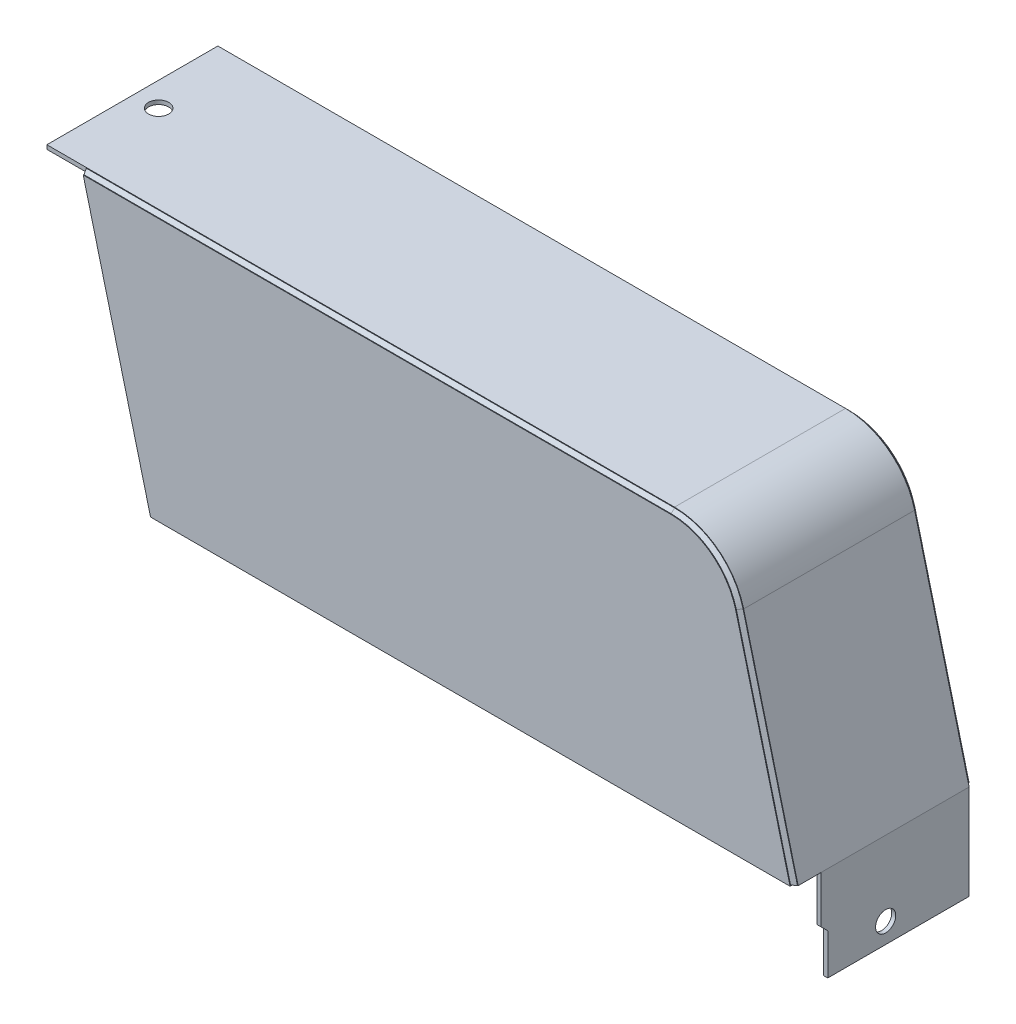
ISO-10303-21;
HEADER;
FILE_DESCRIPTION(('STEP AP214'),'2;1');
FILE_NAME('part.step','',(''),(''),'','','');
FILE_SCHEMA(('AUTOMOTIVE_DESIGN { 1 0 10303 214 1 1 1 1 }'));
ENDSEC;
DATA;
#1=APPLICATION_CONTEXT('core data for automotive mechanical design processes');
#2=APPLICATION_PROTOCOL_DEFINITION('international standard','automotive_design',2000,#1);
#3=PRODUCT_CONTEXT('',#1,'mechanical');
#4=PRODUCT('Part','Part','',(#3));
#5=PRODUCT_RELATED_PRODUCT_CATEGORY('part','',(#4));
#6=PRODUCT_DEFINITION_FORMATION('','',#4);
#7=PRODUCT_DEFINITION_CONTEXT('part definition',#1,'design');
#8=PRODUCT_DEFINITION('design','',#6,#7);
#9=PRODUCT_DEFINITION_SHAPE('','',#8);
#10=(LENGTH_UNIT() NAMED_UNIT(*) SI_UNIT(.MILLI.,.METRE.));
#11=(NAMED_UNIT(*) PLANE_ANGLE_UNIT() SI_UNIT($,.RADIAN.));
#12=(NAMED_UNIT(*) SI_UNIT($,.STERADIAN.) SOLID_ANGLE_UNIT());
#13=UNCERTAINTY_MEASURE_WITH_UNIT(LENGTH_MEASURE(1.E-05),#10,'distance_accuracy_value','');
#14=(GEOMETRIC_REPRESENTATION_CONTEXT(3) GLOBAL_UNCERTAINTY_ASSIGNED_CONTEXT((#13)) GLOBAL_UNIT_ASSIGNED_CONTEXT((#10,
#11,#12)) REPRESENTATION_CONTEXT('',''));
#15=CARTESIAN_POINT('',(0.,0.,0.));
#16=DIRECTION('',(0.,0.,1.));
#17=DIRECTION('',(1.,0.,0.));
#18=AXIS2_PLACEMENT_3D('',#15,#16,#17);
#19=CARTESIAN_POINT('',(-457.592846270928,55.5377980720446,-318.23007240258));
#20=DIRECTION('',(1.,0.,0.));
#21=DIRECTION('',(0.,0.,1.));
#22=AXIS2_PLACEMENT_3D('',#19,#20,#21);
#23=PLANE('',#22);
#24=DIRECTION('',(0.,-1.,0.));
#25=VECTOR('',#24,1.);
#26=CARTESIAN_POINT('',(-457.592846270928,55.5377980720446,-191.23007240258));
#27=LINE('',#26,#25);
#28=CARTESIAN_POINT('',(-457.592846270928,55.5377980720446,-191.23007240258));
#29=VERTEX_POINT('',#28);
#30=CARTESIAN_POINT('',(-457.592846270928,52.5377980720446,-191.23007240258));
#31=VERTEX_POINT('',#30);
#32=EDGE_CURVE('E195',#29,#31,#27,.T.);
#33=ORIENTED_EDGE('',*,*,#32,.F.);
#34=DIRECTION('',(0.,0.,1.));
#35=VECTOR('',#34,1.);
#36=CARTESIAN_POINT('',(-457.592846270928,55.5377980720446,-318.23007240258));
#37=LINE('',#36,#35);
#38=CARTESIAN_POINT('',(-457.592846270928,55.5377980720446,-318.23007240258));
#39=VERTEX_POINT('',#38);
#40=EDGE_CURVE('E242',#39,#29,#37,.T.);
#41=ORIENTED_EDGE('',*,*,#40,.F.);
#42=DIRECTION('',(0.,-1.,0.));
#43=VECTOR('',#42,1.);
#44=CARTESIAN_POINT('',(-457.592846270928,55.5377980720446,-318.23007240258));
#45=LINE('',#44,#43);
#46=CARTESIAN_POINT('',(-457.592846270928,52.5377980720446,-318.23007240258));
#47=VERTEX_POINT('',#46);
#48=EDGE_CURVE('E215',#39,#47,#45,.T.);
#49=ORIENTED_EDGE('',*,*,#48,.T.);
#50=DIRECTION('',(0.,0.,1.));
#51=VECTOR('',#50,1.);
#52=CARTESIAN_POINT('',(-457.592846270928,52.5377980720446,-318.23007240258));
#53=LINE('',#52,#51);
#54=EDGE_CURVE('E266',#47,#31,#53,.T.);
#55=ORIENTED_EDGE('',*,*,#54,.T.);
#56=EDGE_LOOP('',(#33,#41,#49,#55));
#57=FACE_BOUND('',#56,.T.);
#58=ADVANCED_FACE('F41',(#57),#23,.F.);
#59=CARTESIAN_POINT('',(-457.592846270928,52.5377980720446,-318.23007240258));
#60=DIRECTION('',(0.,1.,0.));
#61=DIRECTION('',(-1.,0.,0.));
#62=AXIS2_PLACEMENT_3D('',#59,#60,#61);
#63=PLANE('',#62);
#64=CARTESIAN_POINT('',(-439.592846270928,52.5377980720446,-256.23007240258));
#65=DIRECTION('',(0.,-1.,0.));
#66=DIRECTION('',(-1.,0.,0.));
#67=AXIS2_PLACEMENT_3D('',#64,#65,#66);
#68=CIRCLE('',#67,7.50000000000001);
#69=CARTESIAN_POINT('',(-447.092846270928,52.5377980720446,-256.23007240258));
#70=VERTEX_POINT('',#69);
#71=EDGE_CURVE('E192',#70,#70,#68,.T.);
#72=ORIENTED_EDGE('',*,*,#71,.F.);
#73=EDGE_LOOP('',(#72));
#74=FACE_BOUND('',#73,.T.);
#75=DIRECTION('',(1.,0.,0.));
#76=VECTOR('',#75,1.);
#77=CARTESIAN_POINT('',(-457.592846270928,52.5377980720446,-191.23007240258));
#78=LINE('',#77,#76);
#79=CARTESIAN_POINT('',(8.61017388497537,52.5377980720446,-191.23007240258));
#80=VERTEX_POINT('',#79);
#81=EDGE_CURVE('E198',#31,#80,#78,.T.);
#82=ORIENTED_EDGE('',*,*,#81,.F.);
#83=ORIENTED_EDGE('',*,*,#54,.F.);
#84=DIRECTION('',(1.,0.,0.));
#85=VECTOR('',#84,1.);
#86=CARTESIAN_POINT('',(-457.592846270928,52.5377980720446,-318.23007240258));
#87=LINE('',#86,#85);
#88=CARTESIAN_POINT('',(8.61017388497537,52.5377980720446,-318.23007240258));
#89=VERTEX_POINT('',#88);
#90=EDGE_CURVE('E218',#47,#89,#87,.T.);
#91=ORIENTED_EDGE('',*,*,#90,.T.);
#92=DIRECTION('',(0.,0.,1.));
#93=VECTOR('',#92,1.);
#94=CARTESIAN_POINT('',(8.61017388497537,52.5377980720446,-318.23007240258));
#95=LINE('',#94,#93);
#96=EDGE_CURVE('E263',#89,#80,#95,.T.);
#97=ORIENTED_EDGE('',*,*,#96,.T.);
#98=EDGE_LOOP('',(#82,#83,#91,#97));
#99=FACE_BOUND('',#98,.T.);
#100=ADVANCED_FACE('F284',(#74,#99),#63,.F.);
#101=CARTESIAN_POINT('',(8.61017388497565,2.53779807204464,-318.23007240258));
#102=DIRECTION('',(0.,0.,1.));
#103=DIRECTION('',(-1.,0.,0.));
#104=AXIS2_PLACEMENT_3D('',#101,#102,#103);
#105=CYLINDRICAL_SURFACE('',#104,50.);
#106=CARTESIAN_POINT('',(8.61017388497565,2.53779807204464,-191.23007240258));
#107=DIRECTION('',(0.,0.,-1.));
#108=DIRECTION('',(-1.,0.,0.));
#109=AXIS2_PLACEMENT_3D('',#106,#107,#108);
#110=CIRCLE('',#109,50.);
#111=CARTESIAN_POINT('',(57.043367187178,14.9565655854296,-191.23007240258));
#112=VERTEX_POINT('',#111);
#113=EDGE_CURVE('E201',#80,#112,#110,.T.);
#114=ORIENTED_EDGE('',*,*,#113,.F.);
#115=ORIENTED_EDGE('',*,*,#96,.F.);
#116=CARTESIAN_POINT('',(8.61017388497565,2.53779807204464,-318.23007240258));
#117=DIRECTION('',(0.,0.,-1.));
#118=DIRECTION('',(-1.,0.,0.));
#119=AXIS2_PLACEMENT_3D('',#116,#117,#118);
#120=CIRCLE('',#119,50.);
#121=CARTESIAN_POINT('',(57.043367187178,14.9565655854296,-318.23007240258));
#122=VERTEX_POINT('',#121);
#123=EDGE_CURVE('E221',#89,#122,#120,.T.);
#124=ORIENTED_EDGE('',*,*,#123,.T.);
#125=DIRECTION('',(0.,0.,1.));
#126=VECTOR('',#125,1.);
#127=CARTESIAN_POINT('',(57.043367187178,14.9565655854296,-318.23007240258));
#128=LINE('',#127,#126);
#129=EDGE_CURVE('E260',#122,#112,#128,.T.);
#130=ORIENTED_EDGE('',*,*,#129,.T.);
#131=EDGE_LOOP('',(#114,#115,#124,#130));
#132=FACE_BOUND('',#131,.T.);
#133=ADVANCED_FACE('F282',(#132),#105,.F.);
#134=CARTESIAN_POINT('',(57.043367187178,14.9565655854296,-318.23007240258));
#135=DIRECTION('',(0.968663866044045,0.248375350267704,0.));
#136=DIRECTION('',(-0.248375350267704,0.968663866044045,0.));
#137=AXIS2_PLACEMENT_3D('',#134,#135,#136);
#138=PLANE('',#137);
#139=DIRECTION('',(0.248375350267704,-0.968663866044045,0.));
#140=VECTOR('',#139,1.);
#141=CARTESIAN_POINT('',(57.043367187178,14.9565655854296,-191.23007240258));
#142=LINE('',#141,#140);
#143=CARTESIAN_POINT('',(97.4071537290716,-142.462201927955,-191.23007240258));
#144=VERTEX_POINT('',#143);
#145=EDGE_CURVE('E204',#112,#144,#142,.T.);
#146=ORIENTED_EDGE('',*,*,#145,.F.);
#147=ORIENTED_EDGE('',*,*,#129,.F.);
#148=DIRECTION('',(0.248375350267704,-0.968663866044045,0.));
#149=VECTOR('',#148,1.);
#150=CARTESIAN_POINT('',(57.043367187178,14.9565655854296,-318.23007240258));
#151=LINE('',#150,#149);
#152=CARTESIAN_POINT('',(97.4071537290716,-142.462201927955,-318.23007240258));
#153=VERTEX_POINT('',#152);
#154=EDGE_CURVE('E224',#122,#153,#151,.T.);
#155=ORIENTED_EDGE('',*,*,#154,.T.);
#156=DIRECTION('',(0.,0.,1.));
#157=VECTOR('',#156,1.);
#158=CARTESIAN_POINT('',(97.4071537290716,-142.462201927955,-318.23007240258));
#159=LINE('',#158,#157);
#160=CARTESIAN_POINT('',(97.4071537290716,-142.462201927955,-208.23007240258));
#161=VERTEX_POINT('',#160);
#162=EDGE_CURVE('E257',#153,#161,#159,.T.);
#163=ORIENTED_EDGE('',*,*,#162,.T.);
#164=DIRECTION('',(0.,0.,1.));
#165=VECTOR('',#164,1.);
#166=CARTESIAN_POINT('',(97.4071537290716,-142.462201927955,-318.23007240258));
#167=LINE('',#166,#165);
#168=EDGE_CURVE('E182',#161,#144,#167,.T.);
#169=ORIENTED_EDGE('',*,*,#168,.T.);
#170=EDGE_LOOP('',(#146,#147,#155,#163,#169));
#171=FACE_BOUND('',#170,.T.);
#172=ADVANCED_FACE('F276',(#171),#138,.F.);
#173=CARTESIAN_POINT('',(97.4071537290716,-142.462201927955,-318.23007240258));
#174=DIRECTION('',(1.,0.,0.));
#175=DIRECTION('',(0.,0.,1.));
#176=AXIS2_PLACEMENT_3D('',#173,#174,#175);
#177=PLANE('',#176);
#178=CARTESIAN_POINT('',(97.4071537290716,-197.462201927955,-256.23007240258));
#179=DIRECTION('',(-1.,0.,0.));
#180=DIRECTION('',(0.,0.,1.));
#181=AXIS2_PLACEMENT_3D('',#178,#179,#180);
#182=CIRCLE('',#181,7.5);
#183=CARTESIAN_POINT('',(97.4071537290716,-197.462201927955,-248.73007240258));
#184=VERTEX_POINT('',#183);
#185=EDGE_CURVE('E159',#184,#184,#182,.T.);
#186=ORIENTED_EDGE('',*,*,#185,.F.);
#187=EDGE_LOOP('',(#186));
#188=FACE_BOUND('',#187,.T.);
#189=ORIENTED_EDGE('',*,*,#162,.F.);
#190=DIRECTION('',(0.,-1.,0.));
#191=VECTOR('',#190,1.);
#192=CARTESIAN_POINT('',(97.4071537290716,-142.462201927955,-318.23007240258));
#193=LINE('',#192,#191);
#194=CARTESIAN_POINT('',(97.4071537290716,-212.462201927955,-318.23007240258));
#195=VERTEX_POINT('',#194);
#196=EDGE_CURVE('E227',#153,#195,#193,.T.);
#197=ORIENTED_EDGE('',*,*,#196,.T.);
#198=DIRECTION('',(0.,0.,1.));
#199=VECTOR('',#198,1.);
#200=CARTESIAN_POINT('',(97.4071537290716,-212.462201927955,-318.23007240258));
#201=LINE('',#200,#199);
#202=CARTESIAN_POINT('',(97.4071537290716,-212.462201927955,-213.23007240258));
#203=VERTEX_POINT('',#202);
#204=EDGE_CURVE('E254',#195,#203,#201,.T.);
#205=ORIENTED_EDGE('',*,*,#204,.T.);
#206=DIRECTION('',(0.,-1.,0.));
#207=VECTOR('',#206,1.);
#208=CARTESIAN_POINT('',(97.4071537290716,-182.083708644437,-213.23007240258));
#209=LINE('',#208,#207);
#210=CARTESIAN_POINT('',(97.4071537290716,-182.083708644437,-213.23007240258));
#211=VERTEX_POINT('',#210);
#212=EDGE_CURVE('E175',#211,#203,#209,.T.);
#213=ORIENTED_EDGE('',*,*,#212,.F.);
#214=DIRECTION('',(0.,-0.707106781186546,-0.707106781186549));
#215=VECTOR('',#214,1.);
#216=CARTESIAN_POINT('',(97.4071537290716,-177.083708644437,-208.23007240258));
#217=LINE('',#216,#215);
#218=CARTESIAN_POINT('',(97.4071537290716,-177.083708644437,-208.23007240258));
#219=VERTEX_POINT('',#218);
#220=EDGE_CURVE('E173',#219,#211,#217,.T.);
#221=ORIENTED_EDGE('',*,*,#220,.F.);
#222=DIRECTION('',(0.,-1.,0.));
#223=VECTOR('',#222,1.);
#224=CARTESIAN_POINT('',(97.4071537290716,-142.083708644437,-208.23007240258));
#225=LINE('',#224,#223);
#226=EDGE_CURVE('E144',#161,#219,#225,.T.);
#227=ORIENTED_EDGE('',*,*,#226,.F.);
#228=EDGE_LOOP('',(#189,#197,#205,#213,#221,#227));
#229=FACE_BOUND('',#228,.T.);
#230=ADVANCED_FACE('F290',(#188,#229),#177,.F.);
#231=CARTESIAN_POINT('',(97.4071537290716,-212.462201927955,-318.23007240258));
#232=DIRECTION('',(0.,1.,0.));
#233=DIRECTION('',(0.,0.,-1.));
#234=AXIS2_PLACEMENT_3D('',#231,#232,#233);
#235=PLANE('',#234);
#236=ORIENTED_EDGE('',*,*,#204,.F.);
#237=DIRECTION('',(1.,0.,0.));
#238=VECTOR('',#237,1.);
#239=CARTESIAN_POINT('',(97.4071537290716,-212.462201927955,-318.23007240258));
#240=LINE('',#239,#238);
#241=CARTESIAN_POINT('',(100.407153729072,-212.462201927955,-318.23007240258));
#242=VERTEX_POINT('',#241);
#243=EDGE_CURVE('E230',#195,#242,#240,.T.);
#244=ORIENTED_EDGE('',*,*,#243,.T.);
#245=DIRECTION('',(0.,0.,1.));
#246=VECTOR('',#245,1.);
#247=CARTESIAN_POINT('',(100.407153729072,-212.462201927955,-318.23007240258));
#248=LINE('',#247,#246);
#249=CARTESIAN_POINT('',(100.407153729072,-212.462201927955,-213.23007240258));
#250=VERTEX_POINT('',#249);
#251=EDGE_CURVE('E251',#242,#250,#248,.T.);
#252=ORIENTED_EDGE('',*,*,#251,.T.);
#253=DIRECTION('',(1.,0.,0.));
#254=VECTOR('',#253,1.);
#255=CARTESIAN_POINT('',(97.4071537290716,-212.462201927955,-213.23007240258));
#256=LINE('',#255,#254);
#257=EDGE_CURVE('E186',#203,#250,#256,.T.);
#258=ORIENTED_EDGE('',*,*,#257,.F.);
#259=EDGE_LOOP('',(#236,#244,#252,#258));
#260=FACE_BOUND('',#259,.T.);
#261=ADVANCED_FACE('F296',(#260),#235,.F.);
#262=CARTESIAN_POINT('',(100.407153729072,-142.083708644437,-318.23007240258));
#263=DIRECTION('',(-1.,0.,0.));
#264=DIRECTION('',(0.,0.,-1.));
#265=AXIS2_PLACEMENT_3D('',#262,#263,#264);
#266=PLANE('',#265);
#267=CARTESIAN_POINT('',(100.407153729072,-197.462201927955,-256.23007240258));
#268=DIRECTION('',(-1.,0.,0.));
#269=DIRECTION('',(0.,0.,1.));
#270=AXIS2_PLACEMENT_3D('',#267,#268,#269);
#271=CIRCLE('',#270,7.5);
#272=CARTESIAN_POINT('',(100.407153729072,-197.462201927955,-248.73007240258));
#273=VERTEX_POINT('',#272);
#274=EDGE_CURVE('E404',#273,#273,#271,.T.);
#275=ORIENTED_EDGE('',*,*,#274,.T.);
#276=EDGE_LOOP('',(#275));
#277=FACE_BOUND('',#276,.T.);
#278=DIRECTION('',(0.,-0.707106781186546,-0.707106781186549));
#279=VECTOR('',#278,1.);
#280=CARTESIAN_POINT('',(100.407153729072,-177.083708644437,-208.23007240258));
#281=LINE('',#280,#279);
#282=CARTESIAN_POINT('',(100.407153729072,-177.083708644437,-208.23007240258));
#283=VERTEX_POINT('',#282);
#284=CARTESIAN_POINT('',(100.407153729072,-182.083708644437,-213.23007240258));
#285=VERTEX_POINT('',#284);
#286=EDGE_CURVE('E155',#283,#285,#281,.T.);
#287=ORIENTED_EDGE('',*,*,#286,.T.);
#288=DIRECTION('',(0.,-1.,0.));
#289=VECTOR('',#288,1.);
#290=CARTESIAN_POINT('',(100.407153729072,-182.083708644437,-213.23007240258));
#291=LINE('',#290,#289);
#292=EDGE_CURVE('E163',#285,#250,#291,.T.);
#293=ORIENTED_EDGE('',*,*,#292,.T.);
#294=ORIENTED_EDGE('',*,*,#251,.F.);
#295=DIRECTION('',(0.,1.,0.));
#296=VECTOR('',#295,1.);
#297=CARTESIAN_POINT('',(100.407153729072,-142.083708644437,-318.23007240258));
#298=LINE('',#297,#296);
#299=CARTESIAN_POINT('',(100.407153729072,-142.083708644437,-318.23007240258));
#300=VERTEX_POINT('',#299);
#301=EDGE_CURVE('E233',#242,#300,#298,.T.);
#302=ORIENTED_EDGE('',*,*,#301,.T.);
#303=DIRECTION('',(0.,0.,1.));
#304=VECTOR('',#303,1.);
#305=CARTESIAN_POINT('',(100.407153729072,-142.083708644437,-318.23007240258));
#306=LINE('',#305,#304);
#307=CARTESIAN_POINT('',(100.407153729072,-142.083708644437,-208.23007240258));
#308=VERTEX_POINT('',#307);
#309=EDGE_CURVE('E158',#300,#308,#306,.T.);
#310=ORIENTED_EDGE('',*,*,#309,.T.);
#311=DIRECTION('',(0.,-1.,0.));
#312=VECTOR('',#311,1.);
#313=CARTESIAN_POINT('',(100.407153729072,-142.083708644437,-208.23007240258));
#314=LINE('',#313,#312);
#315=EDGE_CURVE('E141',#308,#283,#314,.T.);
#316=ORIENTED_EDGE('',*,*,#315,.T.);
#317=EDGE_LOOP('',(#287,#293,#294,#302,#310,#316));
#318=FACE_BOUND('',#317,.T.);
#319=ADVANCED_FACE('F154',(#277,#318),#266,.F.);
#320=CARTESIAN_POINT('',(59.9493587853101,15.7016916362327,-318.23007240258));
#321=DIRECTION('',(-0.968663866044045,-0.248375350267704,0.));
#322=DIRECTION('',(0.248375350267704,-0.968663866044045,0.));
#323=AXIS2_PLACEMENT_3D('',#320,#321,#322);
#324=PLANE('',#323);
#325=DIRECTION('',(-0.248375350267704,0.968663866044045,0.));
#326=VECTOR('',#325,1.);
#327=CARTESIAN_POINT('',(59.9493587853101,15.7016916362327,-191.23007240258));
#328=LINE('',#327,#326);
#329=CARTESIAN_POINT('',(100.407153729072,-142.083708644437,-191.23007240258));
#330=VERTEX_POINT('',#329);
#331=CARTESIAN_POINT('',(59.9493587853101,15.7016916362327,-191.23007240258));
#332=VERTEX_POINT('',#331);
#333=EDGE_CURVE('E207',#330,#332,#328,.T.);
#334=ORIENTED_EDGE('',*,*,#333,.F.);
#335=DIRECTION('',(0.,0.,-1.));
#336=VECTOR('',#335,1.);
#337=CARTESIAN_POINT('',(100.407153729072,-142.083708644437,-208.23007240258));
#338=LINE('',#337,#336);
#339=EDGE_CURVE('E165',#330,#308,#338,.T.);
#340=ORIENTED_EDGE('',*,*,#339,.T.);
#341=ORIENTED_EDGE('',*,*,#309,.F.);
#342=DIRECTION('',(-0.248375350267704,0.968663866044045,0.));
#343=VECTOR('',#342,1.);
#344=CARTESIAN_POINT('',(59.9493587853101,15.7016916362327,-318.23007240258));
#345=LINE('',#344,#343);
#346=CARTESIAN_POINT('',(59.9493587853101,15.7016916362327,-318.23007240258));
#347=VERTEX_POINT('',#346);
#348=EDGE_CURVE('E235',#300,#347,#345,.T.);
#349=ORIENTED_EDGE('',*,*,#348,.T.);
#350=DIRECTION('',(0.,0.,1.));
#351=VECTOR('',#350,1.);
#352=CARTESIAN_POINT('',(59.9493587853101,15.7016916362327,-318.23007240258));
#353=LINE('',#352,#351);
#354=EDGE_CURVE('E247',#347,#332,#353,.T.);
#355=ORIENTED_EDGE('',*,*,#354,.T.);
#356=EDGE_LOOP('',(#334,#340,#341,#349,#355));
#357=FACE_BOUND('',#356,.T.);
#358=ADVANCED_FACE('F303',(#357),#324,.F.);
#359=CARTESIAN_POINT('',(8.61017388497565,2.53779807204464,-318.23007240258));
#360=DIRECTION('',(0.,0.,1.));
#361=DIRECTION('',(-1.,0.,0.));
#362=AXIS2_PLACEMENT_3D('',#359,#360,#361);
#363=CYLINDRICAL_SURFACE('',#362,53.);
#364=CARTESIAN_POINT('',(8.61017388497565,2.53779807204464,-191.23007240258));
#365=DIRECTION('',(0.,0.,1.));
#366=DIRECTION('',(-1.,0.,0.));
#367=AXIS2_PLACEMENT_3D('',#364,#365,#366);
#368=CIRCLE('',#367,53.);
#369=CARTESIAN_POINT('',(8.61017388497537,55.5377980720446,-191.23007240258));
#370=VERTEX_POINT('',#369);
#371=EDGE_CURVE('E210',#332,#370,#368,.T.);
#372=ORIENTED_EDGE('',*,*,#371,.F.);
#373=ORIENTED_EDGE('',*,*,#354,.F.);
#374=CARTESIAN_POINT('',(8.61017388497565,2.53779807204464,-318.23007240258));
#375=DIRECTION('',(0.,0.,1.));
#376=DIRECTION('',(-1.,0.,0.));
#377=AXIS2_PLACEMENT_3D('',#374,#375,#376);
#378=CIRCLE('',#377,53.);
#379=CARTESIAN_POINT('',(8.61017388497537,55.5377980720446,-318.23007240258));
#380=VERTEX_POINT('',#379);
#381=EDGE_CURVE('E238',#347,#380,#378,.T.);
#382=ORIENTED_EDGE('',*,*,#381,.T.);
#383=DIRECTION('',(0.,0.,1.));
#384=VECTOR('',#383,1.);
#385=CARTESIAN_POINT('',(8.61017388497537,55.5377980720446,-318.23007240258));
#386=LINE('',#385,#384);
#387=EDGE_CURVE('E244',#380,#370,#386,.T.);
#388=ORIENTED_EDGE('',*,*,#387,.T.);
#389=EDGE_LOOP('',(#372,#373,#382,#388));
#390=FACE_BOUND('',#389,.T.);
#391=ADVANCED_FACE('F317',(#390),#363,.T.);
#392=CARTESIAN_POINT('',(-457.592846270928,55.5377980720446,-318.23007240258));
#393=DIRECTION('',(0.,-1.,0.));
#394=DIRECTION('',(0.,0.,1.));
#395=AXIS2_PLACEMENT_3D('',#392,#393,#394);
#396=PLANE('',#395);
#397=CARTESIAN_POINT('',(-439.592846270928,55.5377980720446,-256.23007240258));
#398=DIRECTION('',(0.,-1.,0.));
#399=DIRECTION('',(0.,0.,-1.));
#400=AXIS2_PLACEMENT_3D('',#397,#398,#399);
#401=CIRCLE('',#400,7.50000000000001);
#402=CARTESIAN_POINT('',(-439.592846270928,55.5377980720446,-263.73007240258));
#403=VERTEX_POINT('',#402);
#404=EDGE_CURVE('E189',#403,#403,#401,.T.);
#405=ORIENTED_EDGE('',*,*,#404,.T.);
#406=EDGE_LOOP('',(#405));
#407=FACE_BOUND('',#406,.T.);
#408=DIRECTION('',(-1.,0.,0.));
#409=VECTOR('',#408,1.);
#410=CARTESIAN_POINT('',(-457.592846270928,55.5377980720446,-191.23007240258));
#411=LINE('',#410,#409);
#412=EDGE_CURVE('E213',#370,#29,#411,.T.);
#413=ORIENTED_EDGE('',*,*,#412,.F.);
#414=ORIENTED_EDGE('',*,*,#387,.F.);
#415=DIRECTION('',(-1.,0.,0.));
#416=VECTOR('',#415,1.);
#417=CARTESIAN_POINT('',(-457.592846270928,55.5377980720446,-318.23007240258));
#418=LINE('',#417,#416);
#419=EDGE_CURVE('E55',#380,#39,#418,.T.);
#420=ORIENTED_EDGE('',*,*,#419,.T.);
#421=ORIENTED_EDGE('',*,*,#40,.T.);
#422=EDGE_LOOP('',(#413,#414,#420,#421));
#423=FACE_BOUND('',#422,.T.);
#424=ADVANCED_FACE('F315',(#407,#423),#396,.F.);
#425=CARTESIAN_POINT('',(8.61017388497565,2.53779807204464,-318.23007240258));
#426=DIRECTION('',(0.,0.,1.));
#427=DIRECTION('',(-1.,0.,0.));
#428=AXIS2_PLACEMENT_3D('',#425,#426,#427);
#429=PLANE('',#428);
#430=ORIENTED_EDGE('',*,*,#48,.F.);
#431=ORIENTED_EDGE('',*,*,#419,.F.);
#432=ORIENTED_EDGE('',*,*,#381,.F.);
#433=ORIENTED_EDGE('',*,*,#348,.F.);
#434=ORIENTED_EDGE('',*,*,#301,.F.);
#435=ORIENTED_EDGE('',*,*,#243,.F.);
#436=ORIENTED_EDGE('',*,*,#196,.F.);
#437=ORIENTED_EDGE('',*,*,#154,.F.);
#438=ORIENTED_EDGE('',*,*,#123,.F.);
#439=ORIENTED_EDGE('',*,*,#90,.F.);
#440=EDGE_LOOP('',(#430,#431,#432,#433,#434,#435,#436,#437,#438,#439));
#441=FACE_BOUND('',#440,.T.);
#442=ADVANCED_FACE('F286',(#441),#429,.F.);
#443=CARTESIAN_POINT('',(8.61017388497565,2.53779807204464,-191.23007240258));
#444=DIRECTION('',(0.,0.,1.));
#445=DIRECTION('',(-1.,0.,0.));
#446=AXIS2_PLACEMENT_3D('',#443,#444,#445);
#447=PLANE('',#446);
#448=DIRECTION('',(1.,0.,0.));
#449=VECTOR('',#448,1.);
#450=CARTESIAN_POINT('',(8.61017388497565,-142.083708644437,-191.23007240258));
#451=LINE('',#450,#449);
#452=CARTESIAN_POINT('',(97.4071537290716,-142.083708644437,-191.23007240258));
#453=VERTEX_POINT('',#452);
#454=EDGE_CURVE('E12',#453,#330,#451,.T.);
#455=ORIENTED_EDGE('',*,*,#454,.T.);
#456=ORIENTED_EDGE('',*,*,#333,.T.);
#457=ORIENTED_EDGE('',*,*,#371,.T.);
#458=ORIENTED_EDGE('',*,*,#412,.T.);
#459=ORIENTED_EDGE('',*,*,#32,.T.);
#460=ORIENTED_EDGE('',*,*,#81,.T.);
#461=ORIENTED_EDGE('',*,*,#113,.T.);
#462=ORIENTED_EDGE('',*,*,#145,.T.);
#463=DIRECTION('',(0.,-1.,0.));
#464=VECTOR('',#463,1.);
#465=CARTESIAN_POINT('',(97.4071537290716,2.53779807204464,-191.23007240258));
#466=LINE('',#465,#464);
#467=EDGE_CURVE('E48',#453,#144,#466,.T.);
#468=ORIENTED_EDGE('',*,*,#467,.F.);
#469=EDGE_LOOP('',(#455,#456,#457,#458,#459,#460,#461,#462,#468));
#470=FACE_BOUND('',#469,.T.);
#471=ADVANCED_FACE('F279',(#470),#447,.T.);
#472=CARTESIAN_POINT('',(-439.592846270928,49.5377980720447,-256.23007240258));
#473=DIRECTION('',(0.,1.,0.));
#474=DIRECTION('',(0.,0.,-1.));
#475=AXIS2_PLACEMENT_3D('',#472,#473,#474);
#476=CYLINDRICAL_SURFACE('',#475,7.50000000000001);
#477=ORIENTED_EDGE('',*,*,#404,.F.);
#478=EDGE_LOOP('',(#477));
#479=FACE_BOUND('',#478,.T.);
#480=ORIENTED_EDGE('',*,*,#71,.T.);
#481=EDGE_LOOP('',(#480));
#482=FACE_BOUND('',#481,.T.);
#483=ADVANCED_FACE('F351',(#479,#482),#476,.F.);
#484=CARTESIAN_POINT('',(97.4071537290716,-182.083708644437,-213.23007240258));
#485=DIRECTION('',(0.,0.,-1.));
#486=DIRECTION('',(0.,-1.,0.));
#487=AXIS2_PLACEMENT_3D('',#484,#485,#486);
#488=PLANE('',#487);
#489=ORIENTED_EDGE('',*,*,#212,.T.);
#490=ORIENTED_EDGE('',*,*,#257,.T.);
#491=ORIENTED_EDGE('',*,*,#292,.F.);
#492=DIRECTION('',(1.,0.,0.));
#493=VECTOR('',#492,1.);
#494=CARTESIAN_POINT('',(97.4071537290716,-182.083708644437,-213.23007240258));
#495=LINE('',#494,#493);
#496=EDGE_CURVE('E149',#211,#285,#495,.T.);
#497=ORIENTED_EDGE('',*,*,#496,.F.);
#498=EDGE_LOOP('',(#489,#490,#491,#497));
#499=FACE_BOUND('',#498,.T.);
#500=ADVANCED_FACE('F293',(#499),#488,.F.);
#501=CARTESIAN_POINT('',(97.4071537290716,-219.661583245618,-208.23007240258));
#502=DIRECTION('',(1.,0.,0.));
#503=DIRECTION('',(0.,0.,1.));
#504=AXIS2_PLACEMENT_3D('',#501,#502,#503);
#505=PLANE('',#504);
#506=ORIENTED_EDGE('',*,*,#168,.F.);
#507=CARTESIAN_POINT('',(97.4071537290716,-142.083708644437,-208.23007240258));
#508=VERTEX_POINT('',#507);
#509=EDGE_CURVE('E171',#508,#161,#225,.T.);
#510=ORIENTED_EDGE('',*,*,#509,.F.);
#511=DIRECTION('',(0.,0.,-1.));
#512=VECTOR('',#511,1.);
#513=CARTESIAN_POINT('',(97.4071537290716,-142.083708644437,-208.23007240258));
#514=LINE('',#513,#512);
#515=EDGE_CURVE('E150',#453,#508,#514,.T.);
#516=ORIENTED_EDGE('',*,*,#515,.F.);
#517=ORIENTED_EDGE('',*,*,#467,.T.);
#518=EDGE_LOOP('',(#506,#510,#516,#517));
#519=FACE_BOUND('',#518,.T.);
#520=ADVANCED_FACE('F271',(#519),#505,.T.);
#521=CARTESIAN_POINT('',(97.4071537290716,-142.083708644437,-208.23007240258));
#522=DIRECTION('',(0.,0.,-1.));
#523=DIRECTION('',(0.,-1.,0.));
#524=AXIS2_PLACEMENT_3D('',#521,#522,#523);
#525=PLANE('',#524);
#526=ORIENTED_EDGE('',*,*,#315,.F.);
#527=DIRECTION('',(1.,0.,0.));
#528=VECTOR('',#527,1.);
#529=CARTESIAN_POINT('',(97.4071537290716,-142.083708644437,-208.23007240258));
#530=LINE('',#529,#528);
#531=EDGE_CURVE('E180',#508,#308,#530,.T.);
#532=ORIENTED_EDGE('',*,*,#531,.F.);
#533=ORIENTED_EDGE('',*,*,#509,.T.);
#534=ORIENTED_EDGE('',*,*,#226,.T.);
#535=DIRECTION('',(1.,0.,0.));
#536=VECTOR('',#535,1.);
#537=CARTESIAN_POINT('',(97.4071537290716,-177.083708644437,-208.23007240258));
#538=LINE('',#537,#536);
#539=EDGE_CURVE('E138',#219,#283,#538,.T.);
#540=ORIENTED_EDGE('',*,*,#539,.T.);
#541=EDGE_LOOP('',(#526,#532,#533,#534,#540));
#542=FACE_BOUND('',#541,.T.);
#543=ADVANCED_FACE('F140',(#542),#525,.F.);
#544=CARTESIAN_POINT('',(97.4071537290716,-142.083708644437,-208.23007240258));
#545=DIRECTION('',(0.,1.,0.));
#546=DIRECTION('',(0.,0.,-1.));
#547=AXIS2_PLACEMENT_3D('',#544,#545,#546);
#548=PLANE('',#547);
#549=ORIENTED_EDGE('',*,*,#454,.F.);
#550=ORIENTED_EDGE('',*,*,#515,.T.);
#551=ORIENTED_EDGE('',*,*,#531,.T.);
#552=ORIENTED_EDGE('',*,*,#339,.F.);
#553=EDGE_LOOP('',(#549,#550,#551,#552));
#554=FACE_BOUND('',#553,.T.);
#555=ADVANCED_FACE('F337',(#554),#548,.F.);
#556=CARTESIAN_POINT('',(97.4071537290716,-177.083708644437,-208.23007240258));
#557=DIRECTION('',(0.,0.707106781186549,-0.707106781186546));
#558=DIRECTION('',(0.,-0.707106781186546,-0.707106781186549));
#559=AXIS2_PLACEMENT_3D('',#556,#557,#558);
#560=PLANE('',#559);
#561=ORIENTED_EDGE('',*,*,#286,.F.);
#562=ORIENTED_EDGE('',*,*,#539,.F.);
#563=ORIENTED_EDGE('',*,*,#220,.T.);
#564=ORIENTED_EDGE('',*,*,#496,.T.);
#565=EDGE_LOOP('',(#561,#562,#563,#564));
#566=FACE_BOUND('',#565,.T.);
#567=ADVANCED_FACE('F161',(#566),#560,.F.);
#568=CARTESIAN_POINT('',(97.4071537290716,-197.462201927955,-256.23007240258));
#569=DIRECTION('',(1.,0.,0.));
#570=DIRECTION('',(0.,0.,1.));
#571=AXIS2_PLACEMENT_3D('',#568,#569,#570);
#572=CYLINDRICAL_SURFACE('',#571,7.5);
#573=ORIENTED_EDGE('',*,*,#185,.T.);
#574=EDGE_LOOP('',(#573));
#575=FACE_BOUND('',#574,.T.);
#576=ORIENTED_EDGE('',*,*,#274,.F.);
#577=EDGE_LOOP('',(#576));
#578=FACE_BOUND('',#577,.T.);
#579=ADVANCED_FACE('F344',(#575,#578),#572,.F.);
#580=CLOSED_SHELL('',(#58,#100,#133,#172,#230,#261,#319,#358,#391,#424,#442,#471,#483,#500,#520,
#543,#555,#567,#579));
#581=MANIFOLD_SOLID_BREP('B2',#580);
#582=CARTESIAN_POINT('',(-427.592846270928,52.5377980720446,-188.23007240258));
#583=DIRECTION('',(0.968663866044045,0.248375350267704,0.));
#584=DIRECTION('',(-0.248375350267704,0.968663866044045,0.));
#585=AXIS2_PLACEMENT_3D('',#582,#583,#584);
#586=PLANE('',#585);
#587=DIRECTION('',(0.,0.,-1.));
#588=VECTOR('',#587,1.);
#589=CARTESIAN_POINT('',(-427.592846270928,52.5377980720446,-188.23007240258));
#590=LINE('',#589,#588);
#591=CARTESIAN_POINT('',(-427.592846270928,52.5377980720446,-188.73007240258));
#592=VERTEX_POINT('',#591);
#593=CARTESIAN_POINT('',(-427.592846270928,52.5377980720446,-191.23007240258));
#594=VERTEX_POINT('',#593);
#595=EDGE_CURVE('E571',#592,#594,#590,.T.);
#596=ORIENTED_EDGE('',*,*,#595,.F.);
#597=DIRECTION('',(0.178400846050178,-0.695763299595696,0.695763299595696));
#598=VECTOR('',#597,1.);
#599=CARTESIAN_POINT('',(-427.530783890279,52.2957547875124,-188.488029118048));
#600=LINE('',#599,#598);
#601=CARTESIAN_POINT('',(-428.233871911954,55.0377980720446,-191.23007240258));
#602=VERTEX_POINT('',#601);
#603=EDGE_CURVE('E603',#602,#592,#600,.T.);
#604=ORIENTED_EDGE('',*,*,#603,.F.);
#605=DIRECTION('',(0.248375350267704,-0.968663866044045,0.));
#606=VECTOR('',#605,1.);
#607=CARTESIAN_POINT('',(-388.653733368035,-99.32474224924,-191.23007240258));
#608=LINE('',#607,#606);
#609=EDGE_CURVE('E595',#602,#594,#608,.T.);
#610=ORIENTED_EDGE('',*,*,#609,.T.);
#611=EDGE_LOOP('',(#596,#604,#610));
#612=FACE_BOUND('',#611,.T.);
#613=ADVANCED_FACE('F489',(#612),#586,.F.);
#614=CARTESIAN_POINT('',(59.465026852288,15.5775039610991,-191.23007240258));
#615=DIRECTION('',(-0.684948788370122,-0.175627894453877,-0.707106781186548));
#616=DIRECTION('',(0.718271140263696,0.,-0.695763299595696));
#617=AXIS2_PLACEMENT_3D('',#614,#615,#616);
#618=PLANE('',#617);
#619=DIRECTION('',(-0.248375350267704,0.968663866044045,0.));
#620=VECTOR('',#619,1.);
#621=CARTESIAN_POINT('',(59.465026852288,15.5775039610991,-191.23007240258));
#622=LINE('',#621,#620);
#623=CARTESIAN_POINT('',(99.8909788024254,-142.083708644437,-191.23007240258));
#624=VERTEX_POINT('',#623);
#625=CARTESIAN_POINT('',(59.465026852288,15.5775039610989,-191.23007240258));
#626=VERTEX_POINT('',#625);
#627=EDGE_CURVE('E588',#624,#626,#622,.T.);
#628=ORIENTED_EDGE('',*,*,#627,.T.);
#629=DIRECTION('',(-0.684948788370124,-0.175627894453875,0.707106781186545));
#630=VECTOR('',#629,1.);
#631=CARTESIAN_POINT('',(59.465026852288,15.5775039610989,-191.23007240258));
#632=LINE('',#631,#630);
#633=CARTESIAN_POINT('',(57.0433671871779,14.9565655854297,-188.73007240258));
#634=VERTEX_POINT('',#633);
#635=EDGE_CURVE('E586',#626,#634,#632,.T.);
#636=ORIENTED_EDGE('',*,*,#635,.T.);
#637=DIRECTION('',(0.248375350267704,-0.968663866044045,0.));
#638=VECTOR('',#637,1.);
#639=CARTESIAN_POINT('',(97.4071537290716,-142.462201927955,-188.73007240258));
#640=LINE('',#639,#638);
#641=CARTESIAN_POINT('',(97.4071537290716,-142.462201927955,-188.73007240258));
#642=VERTEX_POINT('',#641);
#643=EDGE_CURVE('E564',#634,#642,#640,.T.);
#644=ORIENTED_EDGE('',*,*,#643,.T.);
#645=DIRECTION('',(0.,0.970512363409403,-0.241051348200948));
#646=VECTOR('',#645,1.);
#647=CARTESIAN_POINT('',(97.4071537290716,6.97934621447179,-225.847669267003));
#648=LINE('',#647,#646);
#649=CARTESIAN_POINT('',(97.4071537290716,-142.083708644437,-188.824080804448));
#650=VERTEX_POINT('',#649);
#651=EDGE_CURVE('E550',#642,#650,#648,.T.);
#652=ORIENTED_EDGE('',*,*,#651,.T.);
#653=DIRECTION('',(-0.718271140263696,0.,0.695763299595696));
#654=VECTOR('',#653,1.);
#655=CARTESIAN_POINT('',(79.0346872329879,-142.083708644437,-171.027336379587));
#656=LINE('',#655,#654);
#657=EDGE_CURVE('E554',#624,#650,#656,.T.);
#658=ORIENTED_EDGE('',*,*,#657,.F.);
#659=EDGE_LOOP('',(#628,#636,#644,#652,#658));
#660=FACE_BOUND('',#659,.T.);
#661=ADVANCED_FACE('F561',(#660),#618,.F.);
#662=CARTESIAN_POINT('',(8.61017388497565,2.53779807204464,-191.23007240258));
#663=DIRECTION('',(0.,0.,-1.));
#664=DIRECTION('',(1.,0.,0.));
#665=AXIS2_PLACEMENT_3D('',#662,#663,#664);
#666=CONICAL_SURFACE('',#665,52.5,0.785398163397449);
#667=ORIENTED_EDGE('',*,*,#635,.F.);
#668=CARTESIAN_POINT('',(8.61017388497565,2.53779807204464,-191.23007240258));
#669=DIRECTION('',(0.,0.,-1.));
#670=DIRECTION('',(-1.,0.,0.));
#671=AXIS2_PLACEMENT_3D('',#668,#669,#670);
#672=CIRCLE('',#671,52.5);
#673=CARTESIAN_POINT('',(8.61017388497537,55.0377980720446,-191.23007240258));
#674=VERTEX_POINT('',#673);
#675=EDGE_CURVE('E590',#626,#674,#672,.F.);
#676=ORIENTED_EDGE('',*,*,#675,.T.);
#677=DIRECTION('',(0.,-0.707106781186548,0.707106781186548));
#678=VECTOR('',#677,1.);
#679=CARTESIAN_POINT('',(8.61017388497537,55.0377980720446,-191.23007240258));
#680=LINE('',#679,#678);
#681=CARTESIAN_POINT('',(8.61017388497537,52.5377980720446,-188.73007240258));
#682=VERTEX_POINT('',#681);
#683=EDGE_CURVE('E576',#674,#682,#680,.T.);
#684=ORIENTED_EDGE('',*,*,#683,.T.);
#685=CARTESIAN_POINT('',(8.61017388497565,2.53779807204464,-188.73007240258));
#686=DIRECTION('',(0.,0.,-1.));
#687=DIRECTION('',(-1.,0.,0.));
#688=AXIS2_PLACEMENT_3D('',#685,#686,#687);
#689=CIRCLE('',#688,50.);
#690=EDGE_CURVE('E599',#682,#634,#689,.T.);
#691=ORIENTED_EDGE('',*,*,#690,.T.);
#692=EDGE_LOOP('',(#667,#676,#684,#691));
#693=FACE_BOUND('',#692,.T.);
#694=ADVANCED_FACE('F614',(#693),#666,.T.);
#695=CARTESIAN_POINT('',(8.61017388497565,55.0377980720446,-191.23007240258));
#696=DIRECTION('',(0.,-0.707106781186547,-0.707106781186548));
#697=DIRECTION('',(0.,-0.707106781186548,0.707106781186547));
#698=AXIS2_PLACEMENT_3D('',#695,#696,#697);
#699=PLANE('',#698);
#700=ORIENTED_EDGE('',*,*,#683,.F.);
#701=DIRECTION('',(-1.,0.,0.));
#702=VECTOR('',#701,1.);
#703=CARTESIAN_POINT('',(8.61017388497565,55.0377980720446,-191.23007240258));
#704=LINE('',#703,#702);
#705=EDGE_CURVE('E593',#674,#602,#704,.T.);
#706=ORIENTED_EDGE('',*,*,#705,.T.);
#707=ORIENTED_EDGE('',*,*,#603,.T.);
#708=DIRECTION('',(1.,0.,0.));
#709=VECTOR('',#708,1.);
#710=CARTESIAN_POINT('',(8.61017388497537,52.5377980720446,-188.73007240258));
#711=LINE('',#710,#709);
#712=EDGE_CURVE('E510',#592,#682,#711,.T.);
#713=ORIENTED_EDGE('',*,*,#712,.T.);
#714=EDGE_LOOP('',(#700,#706,#707,#713));
#715=FACE_BOUND('',#714,.T.);
#716=ADVANCED_FACE('F617',(#715),#699,.F.);
#717=CARTESIAN_POINT('',(97.4071537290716,-142.462201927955,-188.23007240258));
#718=DIRECTION('',(-0.968663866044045,-0.248375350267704,0.));
#719=DIRECTION('',(0.248375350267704,-0.968663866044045,0.));
#720=AXIS2_PLACEMENT_3D('',#717,#718,#719);
#721=PLANE('',#720);
#722=ORIENTED_EDGE('',*,*,#643,.F.);
#723=DIRECTION('',(0.,0.,-1.));
#724=VECTOR('',#723,1.);
#725=CARTESIAN_POINT('',(57.0433671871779,14.9565655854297,-188.23007240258));
#726=LINE('',#725,#724);
#727=CARTESIAN_POINT('',(57.0433671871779,14.9565655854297,-191.23007240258));
#728=VERTEX_POINT('',#727);
#729=EDGE_CURVE('E578',#634,#728,#726,.T.);
#730=ORIENTED_EDGE('',*,*,#729,.T.);
#731=DIRECTION('',(-0.248375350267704,0.968663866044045,0.));
#732=VECTOR('',#731,1.);
#733=CARTESIAN_POINT('',(57.0433671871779,14.9565655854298,-191.23007240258));
#734=LINE('',#733,#732);
#735=CARTESIAN_POINT('',(97.4071537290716,-142.462201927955,-191.23007240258));
#736=VERTEX_POINT('',#735);
#737=EDGE_CURVE('E567',#736,#728,#734,.T.);
#738=ORIENTED_EDGE('',*,*,#737,.F.);
#739=DIRECTION('',(0.,0.,-1.));
#740=VECTOR('',#739,1.);
#741=CARTESIAN_POINT('',(97.4071537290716,-142.462201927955,-188.23007240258));
#742=LINE('',#741,#740);
#743=EDGE_CURVE('E559',#642,#736,#742,.T.);
#744=ORIENTED_EDGE('',*,*,#743,.F.);
#745=EDGE_LOOP('',(#722,#730,#738,#744));
#746=FACE_BOUND('',#745,.T.);
#747=ADVANCED_FACE('F608',(#746),#721,.T.);
#748=CARTESIAN_POINT('',(8.61017388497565,2.53779807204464,-191.23007240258));
#749=DIRECTION('',(0.,0.,1.));
#750=DIRECTION('',(-1.,0.,0.));
#751=AXIS2_PLACEMENT_3D('',#748,#749,#750);
#752=PLANE('',#751);
#753=DIRECTION('',(0.,-1.,0.));
#754=VECTOR('',#753,1.);
#755=CARTESIAN_POINT('',(97.4071537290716,2.53779807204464,-191.23007240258));
#756=LINE('',#755,#754);
#757=CARTESIAN_POINT('',(97.4071537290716,-142.083708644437,-191.23007240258));
#758=VERTEX_POINT('',#757);
#759=EDGE_CURVE('E496',#758,#736,#756,.T.);
#760=ORIENTED_EDGE('',*,*,#759,.T.);
#761=ORIENTED_EDGE('',*,*,#737,.T.);
#762=CARTESIAN_POINT('',(8.61017388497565,2.53779807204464,-191.23007240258));
#763=DIRECTION('',(0.,0.,-1.));
#764=DIRECTION('',(-1.,0.,0.));
#765=AXIS2_PLACEMENT_3D('',#762,#763,#764);
#766=CIRCLE('',#765,50.);
#767=CARTESIAN_POINT('',(8.61017388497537,52.5377980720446,-191.23007240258));
#768=VERTEX_POINT('',#767);
#769=EDGE_CURVE('E570',#728,#768,#766,.F.);
#770=ORIENTED_EDGE('',*,*,#769,.T.);
#771=DIRECTION('',(-1.,0.,0.));
#772=VECTOR('',#771,1.);
#773=CARTESIAN_POINT('',(8.61017388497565,52.5377980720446,-191.23007240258));
#774=LINE('',#773,#772);
#775=EDGE_CURVE('E574',#768,#594,#774,.T.);
#776=ORIENTED_EDGE('',*,*,#775,.T.);
#777=ORIENTED_EDGE('',*,*,#609,.F.);
#778=ORIENTED_EDGE('',*,*,#705,.F.);
#779=ORIENTED_EDGE('',*,*,#675,.F.);
#780=ORIENTED_EDGE('',*,*,#627,.F.);
#781=DIRECTION('',(1.,0.,0.));
#782=VECTOR('',#781,1.);
#783=CARTESIAN_POINT('',(8.61017388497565,-142.083708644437,-191.23007240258));
#784=LINE('',#783,#782);
#785=EDGE_CURVE('E39',#758,#624,#784,.T.);
#786=ORIENTED_EDGE('',*,*,#785,.F.);
#787=EDGE_LOOP('',(#760,#761,#770,#776,#777,#778,#779,#780,#786));
#788=FACE_BOUND('',#787,.T.);
#789=ADVANCED_FACE('F605',(#788),#752,.F.);
#790=CARTESIAN_POINT('',(8.61017388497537,52.5377980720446,-188.23007240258));
#791=DIRECTION('',(0.,-1.,0.));
#792=DIRECTION('',(1.,0.,0.));
#793=AXIS2_PLACEMENT_3D('',#790,#791,#792);
#794=PLANE('',#793);
#795=ORIENTED_EDGE('',*,*,#712,.F.);
#796=ORIENTED_EDGE('',*,*,#595,.T.);
#797=ORIENTED_EDGE('',*,*,#775,.F.);
#798=DIRECTION('',(0.,0.,-1.));
#799=VECTOR('',#798,1.);
#800=CARTESIAN_POINT('',(8.61017388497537,52.5377980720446,-188.23007240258));
#801=LINE('',#800,#799);
#802=EDGE_CURVE('E580',#682,#768,#801,.T.);
#803=ORIENTED_EDGE('',*,*,#802,.F.);
#804=EDGE_LOOP('',(#795,#796,#797,#803));
#805=FACE_BOUND('',#804,.T.);
#806=ADVANCED_FACE('F623',(#805),#794,.T.);
#807=CARTESIAN_POINT('',(8.61017388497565,2.53779807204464,-188.23007240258));
#808=DIRECTION('',(0.,0.,-1.));
#809=DIRECTION('',(1.,0.,0.));
#810=AXIS2_PLACEMENT_3D('',#807,#808,#809);
#811=CYLINDRICAL_SURFACE('',#810,50.);
#812=ORIENTED_EDGE('',*,*,#690,.F.);
#813=ORIENTED_EDGE('',*,*,#802,.T.);
#814=ORIENTED_EDGE('',*,*,#769,.F.);
#815=ORIENTED_EDGE('',*,*,#729,.F.);
#816=EDGE_LOOP('',(#812,#813,#814,#815));
#817=FACE_BOUND('',#816,.T.);
#818=ADVANCED_FACE('F611',(#817),#811,.F.);
#819=CARTESIAN_POINT('',(97.4071537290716,-142.083708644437,-208.23007240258));
#820=DIRECTION('',(0.,1.,0.));
#821=DIRECTION('',(0.,0.,-1.));
#822=AXIS2_PLACEMENT_3D('',#819,#820,#821);
#823=PLANE('',#822);
#824=ORIENTED_EDGE('',*,*,#785,.T.);
#825=ORIENTED_EDGE('',*,*,#657,.T.);
#826=DIRECTION('',(0.,0.,-1.));
#827=VECTOR('',#826,1.);
#828=CARTESIAN_POINT('',(97.4071537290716,-142.083708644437,-208.23007240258));
#829=LINE('',#828,#827);
#830=EDGE_CURVE('E502',#650,#758,#829,.T.);
#831=ORIENTED_EDGE('',*,*,#830,.T.);
#832=EDGE_LOOP('',(#824,#825,#831));
#833=FACE_BOUND('',#832,.T.);
#834=ADVANCED_FACE('F555',(#833),#823,.F.);
#835=CARTESIAN_POINT('',(97.4071537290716,-219.661583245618,-208.23007240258));
#836=DIRECTION('',(1.,0.,0.));
#837=DIRECTION('',(0.,0.,1.));
#838=AXIS2_PLACEMENT_3D('',#835,#836,#837);
#839=PLANE('',#838);
#840=ORIENTED_EDGE('',*,*,#651,.F.);
#841=ORIENTED_EDGE('',*,*,#743,.T.);
#842=ORIENTED_EDGE('',*,*,#759,.F.);
#843=ORIENTED_EDGE('',*,*,#830,.F.);
#844=EDGE_LOOP('',(#840,#841,#842,#843));
#845=FACE_BOUND('',#844,.T.);
#846=ADVANCED_FACE('F547',(#845),#839,.T.);
#847=CLOSED_SHELL('',(#613,#661,#694,#716,#747,#789,#806,#818,#834,#846));
#848=MANIFOLD_SOLID_BREP('B6',#847);
#849=CARTESIAN_POINT('',(-427.592846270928,52.5377980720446,-321.23007240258));
#850=DIRECTION('',(0.968663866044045,0.248375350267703,0.));
#851=DIRECTION('',(-0.248375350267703,0.968663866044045,0.));
#852=AXIS2_PLACEMENT_3D('',#849,#850,#851);
#853=PLANE('',#852);
#854=DIRECTION('',(0.,0.,1.));
#855=VECTOR('',#854,1.);
#856=CARTESIAN_POINT('',(-427.592846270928,52.5377980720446,-321.23007240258));
#857=LINE('',#856,#855);
#858=CARTESIAN_POINT('',(-427.592846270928,52.5377980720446,-320.73007240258));
#859=VERTEX_POINT('',#858);
#860=CARTESIAN_POINT('',(-427.592846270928,52.5377980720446,-318.23007240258));
#861=VERTEX_POINT('',#860);
#862=EDGE_CURVE('E774',#859,#861,#857,.T.);
#863=ORIENTED_EDGE('',*,*,#862,.T.);
#864=DIRECTION('',(-0.248375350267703,0.968663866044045,0.));
#865=VECTOR('',#864,1.);
#866=CARTESIAN_POINT('',(-427.592846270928,52.5377980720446,-318.23007240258));
#867=LINE('',#866,#865);
#868=CARTESIAN_POINT('',(-428.233871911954,55.0377980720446,-318.23007240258));
#869=VERTEX_POINT('',#868);
#870=EDGE_CURVE('E782',#861,#869,#867,.T.);
#871=ORIENTED_EDGE('',*,*,#870,.T.);
#872=DIRECTION('',(0.178400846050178,-0.695763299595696,-0.695763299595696));
#873=VECTOR('',#872,1.);
#874=CARTESIAN_POINT('',(-427.530783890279,52.2957547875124,-320.972115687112));
#875=LINE('',#874,#873);
#876=EDGE_CURVE('E487',#859,#869,#875,.F.);
#877=ORIENTED_EDGE('',*,*,#876,.F.);
#878=EDGE_LOOP('',(#863,#871,#877));
#879=FACE_BOUND('',#878,.T.);
#880=ADVANCED_FACE('F714',(#879),#853,.F.);
#881=CARTESIAN_POINT('',(97.4071537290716,-142.462201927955,-321.23007240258));
#882=DIRECTION('',(0.,1.,0.));
#883=DIRECTION('',(0.,0.,-1.));
#884=AXIS2_PLACEMENT_3D('',#881,#882,#883);
#885=PLANE('',#884);
#886=DIRECTION('',(0.,0.,1.));
#887=VECTOR('',#886,1.);
#888=CARTESIAN_POINT('',(97.4071537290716,-142.462201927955,-321.23007240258));
#889=LINE('',#888,#887);
#890=CARTESIAN_POINT('',(97.4071537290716,-142.462201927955,-320.73007240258));
#891=VERTEX_POINT('',#890);
#892=CARTESIAN_POINT('',(97.4071537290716,-142.462201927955,-318.23007240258));
#893=VERTEX_POINT('',#892);
#894=EDGE_CURVE('E789',#891,#893,#889,.T.);
#895=ORIENTED_EDGE('',*,*,#894,.F.);
#896=DIRECTION('',(0.718271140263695,0.,0.695763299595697));
#897=VECTOR('',#896,1.);
#898=CARTESIAN_POINT('',(97.1572803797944,-142.462201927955,-320.972115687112));
#899=LINE('',#898,#897);
#900=CARTESIAN_POINT('',(99.988028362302,-142.462201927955,-318.23007240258));
#901=VERTEX_POINT('',#900);
#902=EDGE_CURVE('E722',#901,#891,#899,.F.);
#903=ORIENTED_EDGE('',*,*,#902,.F.);
#904=DIRECTION('',(-1.,0.,0.));
#905=VECTOR('',#904,1.);
#906=CARTESIAN_POINT('',(97.4071537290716,-142.462201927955,-318.23007240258));
#907=LINE('',#906,#905);
#908=EDGE_CURVE('E807',#901,#893,#907,.T.);
#909=ORIENTED_EDGE('',*,*,#908,.T.);
#910=EDGE_LOOP('',(#895,#903,#909));
#911=FACE_BOUND('',#910,.T.);
#912=ADVANCED_FACE('F716',(#911),#885,.F.);
#913=CARTESIAN_POINT('',(-427.592846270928,52.5377980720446,-320.73007240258));
#914=DIRECTION('',(0.,0.707106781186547,-0.707106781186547));
#915=DIRECTION('',(0.,-0.707106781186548,-0.707106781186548));
#916=AXIS2_PLACEMENT_3D('',#913,#914,#915);
#917=PLANE('',#916);
#918=ORIENTED_EDGE('',*,*,#876,.T.);
#919=DIRECTION('',(1.,0.,0.));
#920=VECTOR('',#919,1.);
#921=CARTESIAN_POINT('',(8.61017388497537,55.0377980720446,-318.23007240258));
#922=LINE('',#921,#920);
#923=CARTESIAN_POINT('',(8.61017388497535,55.0377980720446,-318.23007240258));
#924=VERTEX_POINT('',#923);
#925=EDGE_CURVE('E785',#869,#924,#922,.T.);
#926=ORIENTED_EDGE('',*,*,#925,.T.);
#927=DIRECTION('',(0.,-0.707106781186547,-0.707106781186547));
#928=VECTOR('',#927,1.);
#929=CARTESIAN_POINT('',(8.61017388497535,55.0377980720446,-318.23007240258));
#930=LINE('',#929,#928);
#931=CARTESIAN_POINT('',(8.61017388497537,52.5377980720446,-320.73007240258));
#932=VERTEX_POINT('',#931);
#933=EDGE_CURVE('E799',#924,#932,#930,.T.);
#934=ORIENTED_EDGE('',*,*,#933,.T.);
#935=DIRECTION('',(-1.,0.,0.));
#936=VECTOR('',#935,1.);
#937=CARTESIAN_POINT('',(-427.592846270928,52.5377980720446,-320.73007240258));
#938=LINE('',#937,#936);
#939=EDGE_CURVE('E736',#932,#859,#938,.T.);
#940=ORIENTED_EDGE('',*,*,#939,.T.);
#941=EDGE_LOOP('',(#918,#926,#934,#940));
#942=FACE_BOUND('',#941,.T.);
#943=ADVANCED_FACE('F830',(#942),#917,.T.);
#944=CARTESIAN_POINT('',(8.61017388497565,2.53779807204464,-320.73007240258));
#945=DIRECTION('',(0.,0.,1.));
#946=DIRECTION('',(-1.,0.,0.));
#947=AXIS2_PLACEMENT_3D('',#944,#945,#946);
#948=CONICAL_SURFACE('',#947,50.,0.785398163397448);
#949=ORIENTED_EDGE('',*,*,#933,.F.);
#950=CARTESIAN_POINT('',(8.61017388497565,2.53779807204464,-318.23007240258));
#951=DIRECTION('',(0.,0.,-1.));
#952=DIRECTION('',(-1.,0.,0.));
#953=AXIS2_PLACEMENT_3D('',#950,#951,#952);
#954=CIRCLE('',#953,52.5);
#955=CARTESIAN_POINT('',(59.4650268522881,15.5775039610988,-318.23007240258));
#956=VERTEX_POINT('',#955);
#957=EDGE_CURVE('E787',#924,#956,#954,.T.);
#958=ORIENTED_EDGE('',*,*,#957,.T.);
#959=DIRECTION('',(-0.68494878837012,-0.175627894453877,-0.707106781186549));
#960=VECTOR('',#959,1.);
#961=CARTESIAN_POINT('',(59.4650268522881,15.5775039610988,-318.23007240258));
#962=LINE('',#961,#960);
#963=CARTESIAN_POINT('',(57.043367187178,14.9565655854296,-320.73007240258));
#964=VERTEX_POINT('',#963);
#965=EDGE_CURVE('E778',#956,#964,#962,.T.);
#966=ORIENTED_EDGE('',*,*,#965,.T.);
#967=CARTESIAN_POINT('',(8.61017388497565,2.53779807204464,-320.73007240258));
#968=DIRECTION('',(0.,0.,-1.));
#969=DIRECTION('',(-1.,0.,0.));
#970=AXIS2_PLACEMENT_3D('',#967,#968,#969);
#971=CIRCLE('',#970,50.);
#972=EDGE_CURVE('E810',#964,#932,#971,.F.);
#973=ORIENTED_EDGE('',*,*,#972,.T.);
#974=EDGE_LOOP('',(#949,#958,#966,#973));
#975=FACE_BOUND('',#974,.T.);
#976=ADVANCED_FACE('F829',(#975),#948,.T.);
#977=CARTESIAN_POINT('',(57.043367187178,14.9565655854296,-320.73007240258));
#978=DIRECTION('',(0.684948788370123,0.175627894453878,-0.707106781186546));
#979=DIRECTION('',(0.718271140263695,0.,0.695763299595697));
#980=AXIS2_PLACEMENT_3D('',#977,#978,#979);
#981=PLANE('',#980);
#982=ORIENTED_EDGE('',*,*,#902,.T.);
#983=DIRECTION('',(-0.248375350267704,0.968663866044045,0.));
#984=VECTOR('',#983,1.);
#985=CARTESIAN_POINT('',(57.043367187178,14.9565655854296,-320.73007240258));
#986=LINE('',#985,#984);
#987=EDGE_CURVE('E729',#891,#964,#986,.T.);
#988=ORIENTED_EDGE('',*,*,#987,.T.);
#989=ORIENTED_EDGE('',*,*,#965,.F.);
#990=DIRECTION('',(0.248375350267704,-0.968663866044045,0.));
#991=VECTOR('',#990,1.);
#992=CARTESIAN_POINT('',(99.8288133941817,-141.841263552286,-318.23007240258));
#993=LINE('',#992,#991);
#994=EDGE_CURVE('E805',#956,#901,#993,.T.);
#995=ORIENTED_EDGE('',*,*,#994,.T.);
#996=EDGE_LOOP('',(#982,#988,#989,#995));
#997=FACE_BOUND('',#996,.T.);
#998=ADVANCED_FACE('F816',(#997),#981,.T.);
#999=CARTESIAN_POINT('',(-427.592846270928,52.5377980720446,-321.23007240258));
#1000=DIRECTION('',(0.,-1.,0.));
#1001=DIRECTION('',(1.,0.,0.));
#1002=AXIS2_PLACEMENT_3D('',#999,#1000,#1001);
#1003=PLANE('',#1002);
#1004=ORIENTED_EDGE('',*,*,#939,.F.);
#1005=DIRECTION('',(0.,0.,-1.));
#1006=VECTOR('',#1005,1.);
#1007=CARTESIAN_POINT('',(8.61017388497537,52.5377980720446,-321.23007240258));
#1008=LINE('',#1007,#1006);
#1009=CARTESIAN_POINT('',(8.61017388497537,52.5377980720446,-318.23007240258));
#1010=VERTEX_POINT('',#1009);
#1011=EDGE_CURVE('E775',#932,#1010,#1008,.F.);
#1012=ORIENTED_EDGE('',*,*,#1011,.T.);
#1013=DIRECTION('',(-1.,0.,0.));
#1014=VECTOR('',#1013,1.);
#1015=CARTESIAN_POINT('',(8.61017388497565,52.5377980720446,-318.23007240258));
#1016=LINE('',#1015,#1014);
#1017=EDGE_CURVE('E770',#1010,#861,#1016,.T.);
#1018=ORIENTED_EDGE('',*,*,#1017,.T.);
#1019=ORIENTED_EDGE('',*,*,#862,.F.);
#1020=EDGE_LOOP('',(#1004,#1012,#1018,#1019));
#1021=FACE_BOUND('',#1020,.T.);
#1022=ADVANCED_FACE('F772',(#1021),#1003,.T.);
#1023=CARTESIAN_POINT('',(8.61017388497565,2.53779807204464,-318.23007240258));
#1024=DIRECTION('',(0.,0.,1.));
#1025=DIRECTION('',(-1.,0.,0.));
#1026=AXIS2_PLACEMENT_3D('',#1023,#1024,#1025);
#1027=PLANE('',#1026);
#1028=ORIENTED_EDGE('',*,*,#870,.F.);
#1029=ORIENTED_EDGE('',*,*,#1017,.F.);
#1030=CARTESIAN_POINT('',(8.61017388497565,2.53779807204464,-318.23007240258));
#1031=DIRECTION('',(0.,0.,-1.));
#1032=DIRECTION('',(-1.,0.,0.));
#1033=AXIS2_PLACEMENT_3D('',#1030,#1031,#1032);
#1034=CIRCLE('',#1033,50.);
#1035=CARTESIAN_POINT('',(57.043367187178,14.9565655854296,-318.23007240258));
#1036=VERTEX_POINT('',#1035);
#1037=EDGE_CURVE('E779',#1036,#1010,#1034,.F.);
#1038=ORIENTED_EDGE('',*,*,#1037,.F.);
#1039=DIRECTION('',(-0.248375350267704,0.968663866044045,0.));
#1040=VECTOR('',#1039,1.);
#1041=CARTESIAN_POINT('',(57.0433671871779,14.9565655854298,-318.23007240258));
#1042=LINE('',#1041,#1040);
#1043=EDGE_CURVE('E791',#893,#1036,#1042,.T.);
#1044=ORIENTED_EDGE('',*,*,#1043,.F.);
#1045=ORIENTED_EDGE('',*,*,#908,.F.);
#1046=ORIENTED_EDGE('',*,*,#994,.F.);
#1047=ORIENTED_EDGE('',*,*,#957,.F.);
#1048=ORIENTED_EDGE('',*,*,#925,.F.);
#1049=EDGE_LOOP('',(#1028,#1029,#1038,#1044,#1045,#1046,#1047,#1048));
#1050=FACE_BOUND('',#1049,.T.);
#1051=ADVANCED_FACE('F783',(#1050),#1027,.T.);
#1052=CARTESIAN_POINT('',(8.61017388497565,2.53779807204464,-321.23007240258));
#1053=DIRECTION('',(0.,0.,1.));
#1054=DIRECTION('',(-1.,0.,0.));
#1055=AXIS2_PLACEMENT_3D('',#1052,#1053,#1054);
#1056=CYLINDRICAL_SURFACE('',#1055,50.);
#1057=ORIENTED_EDGE('',*,*,#972,.F.);
#1058=DIRECTION('',(0.,0.,1.));
#1059=VECTOR('',#1058,1.);
#1060=CARTESIAN_POINT('',(57.043367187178,14.9565655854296,-321.23007240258));
#1061=LINE('',#1060,#1059);
#1062=EDGE_CURVE('E793',#964,#1036,#1061,.T.);
#1063=ORIENTED_EDGE('',*,*,#1062,.T.);
#1064=ORIENTED_EDGE('',*,*,#1037,.T.);
#1065=ORIENTED_EDGE('',*,*,#1011,.F.);
#1066=EDGE_LOOP('',(#1057,#1063,#1064,#1065));
#1067=FACE_BOUND('',#1066,.T.);
#1068=ADVANCED_FACE('F826',(#1067),#1056,.F.);
#1069=CARTESIAN_POINT('',(57.043367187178,14.9565655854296,-321.23007240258));
#1070=DIRECTION('',(-0.968663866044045,-0.248375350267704,0.));
#1071=DIRECTION('',(0.248375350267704,-0.968663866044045,0.));
#1072=AXIS2_PLACEMENT_3D('',#1069,#1070,#1071);
#1073=PLANE('',#1072);
#1074=ORIENTED_EDGE('',*,*,#987,.F.);
#1075=ORIENTED_EDGE('',*,*,#894,.T.);
#1076=ORIENTED_EDGE('',*,*,#1043,.T.);
#1077=ORIENTED_EDGE('',*,*,#1062,.F.);
#1078=EDGE_LOOP('',(#1074,#1075,#1076,#1077));
#1079=FACE_BOUND('',#1078,.T.);
#1080=ADVANCED_FACE('F822',(#1079),#1073,.T.);
#1081=CLOSED_SHELL('',(#880,#912,#943,#976,#998,#1022,#1051,#1068,#1080));
#1082=MANIFOLD_SOLID_BREP('B33',#1081);
#1083=CARTESIAN_POINT('',(97.4071537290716,-142.462201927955,-188.23007240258));
#1084=DIRECTION('',(0.,1.,0.));
#1085=DIRECTION('',(-1.,0.,0.));
#1086=AXIS2_PLACEMENT_3D('',#1083,#1084,#1085);
#1087=PLANE('',#1086);
#1088=DIRECTION('',(-1.,0.,0.));
#1089=VECTOR('',#1088,1.);
#1090=CARTESIAN_POINT('',(97.4071537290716,-142.462201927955,-194.23007240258));
#1091=LINE('',#1090,#1089);
#1092=CARTESIAN_POINT('',(97.4071537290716,-142.462201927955,-194.23007240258));
#1093=VERTEX_POINT('',#1092);
#1094=CARTESIAN_POINT('',(-377.592846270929,-142.462201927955,-194.23007240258));
#1095=VERTEX_POINT('',#1094);
#1096=EDGE_CURVE('E966',#1093,#1095,#1091,.T.);
#1097=ORIENTED_EDGE('',*,*,#1096,.F.);
#1098=DIRECTION('',(0.,0.,-1.));
#1099=VECTOR('',#1098,1.);
#1100=CARTESIAN_POINT('',(97.4071537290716,-142.462201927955,-188.23007240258));
#1101=LINE('',#1100,#1099);
#1102=CARTESIAN_POINT('',(97.4071537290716,-142.462201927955,-188.23007240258));
#1103=VERTEX_POINT('',#1102);
#1104=EDGE_CURVE('E991',#1103,#1093,#1101,.T.);
#1105=ORIENTED_EDGE('',*,*,#1104,.F.);
#1106=DIRECTION('',(-1.,0.,0.));
#1107=VECTOR('',#1106,1.);
#1108=CARTESIAN_POINT('',(97.4071537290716,-142.462201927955,-188.23007240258));
#1109=LINE('',#1108,#1107);
#1110=CARTESIAN_POINT('',(-377.592846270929,-142.462201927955,-188.23007240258));
#1111=VERTEX_POINT('',#1110);
#1112=EDGE_CURVE('E971',#1103,#1111,#1109,.T.);
#1113=ORIENTED_EDGE('',*,*,#1112,.T.);
#1114=DIRECTION('',(0.,0.,-1.));
#1115=VECTOR('',#1114,1.);
#1116=CARTESIAN_POINT('',(-377.592846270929,-142.462201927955,-188.23007240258));
#1117=LINE('',#1116,#1115);
#1118=EDGE_CURVE('E712',#1111,#1095,#1117,.T.);
#1119=ORIENTED_EDGE('',*,*,#1118,.T.);
#1120=EDGE_LOOP('',(#1097,#1105,#1113,#1119));
#1121=FACE_BOUND('',#1120,.T.);
#1122=ADVANCED_FACE('F912',(#1121),#1087,.F.);
#1123=CARTESIAN_POINT('',(-427.592846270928,52.5377980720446,-188.23007240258));
#1124=DIRECTION('',(0.968663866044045,0.248375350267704,0.));
#1125=DIRECTION('',(-0.248375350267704,0.968663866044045,0.));
#1126=AXIS2_PLACEMENT_3D('',#1123,#1124,#1125);
#1127=PLANE('',#1126);
#1128=DIRECTION('',(-0.248375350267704,0.968663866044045,0.));
#1129=VECTOR('',#1128,1.);
#1130=CARTESIAN_POINT('',(-427.592846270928,52.5377980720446,-194.23007240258));
#1131=LINE('',#1130,#1129);
#1132=CARTESIAN_POINT('',(-427.592846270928,52.5377980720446,-194.23007240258));
#1133=VERTEX_POINT('',#1132);
#1134=EDGE_CURVE('E957',#1095,#1133,#1131,.T.);
#1135=ORIENTED_EDGE('',*,*,#1134,.F.);
#1136=ORIENTED_EDGE('',*,*,#1118,.F.);
#1137=DIRECTION('',(-0.248375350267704,0.968663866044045,0.));
#1138=VECTOR('',#1137,1.);
#1139=CARTESIAN_POINT('',(-427.592846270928,52.5377980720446,-188.23007240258));
#1140=LINE('',#1139,#1138);
#1141=CARTESIAN_POINT('',(-427.592846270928,52.5377980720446,-188.23007240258));
#1142=VERTEX_POINT('',#1141);
#1143=EDGE_CURVE('E982',#1111,#1142,#1140,.T.);
#1144=ORIENTED_EDGE('',*,*,#1143,.T.);
#1145=DIRECTION('',(0.,0.,-1.));
#1146=VECTOR('',#1145,1.);
#1147=CARTESIAN_POINT('',(-427.592846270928,52.5377980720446,-188.23007240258));
#1148=LINE('',#1147,#1146);
#1149=EDGE_CURVE('E919',#1142,#1133,#1148,.T.);
#1150=ORIENTED_EDGE('',*,*,#1149,.T.);
#1151=EDGE_LOOP('',(#1135,#1136,#1144,#1150));
#1152=FACE_BOUND('',#1151,.T.);
#1153=ADVANCED_FACE('F958',(#1152),#1127,.F.);
#1154=CARTESIAN_POINT('',(8.61017388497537,52.5377980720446,-188.23007240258));
#1155=DIRECTION('',(0.,-1.,0.));
#1156=DIRECTION('',(1.,0.,0.));
#1157=AXIS2_PLACEMENT_3D('',#1154,#1155,#1156);
#1158=PLANE('',#1157);
#1159=DIRECTION('',(1.,0.,0.));
#1160=VECTOR('',#1159,1.);
#1161=CARTESIAN_POINT('',(8.61017388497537,52.5377980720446,-194.23007240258));
#1162=LINE('',#1161,#1160);
#1163=CARTESIAN_POINT('',(8.61017388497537,52.5377980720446,-194.23007240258));
#1164=VERTEX_POINT('',#1163);
#1165=EDGE_CURVE('E965',#1133,#1164,#1162,.T.);
#1166=ORIENTED_EDGE('',*,*,#1165,.F.);
#1167=ORIENTED_EDGE('',*,*,#1149,.F.);
#1168=DIRECTION('',(1.,0.,0.));
#1169=VECTOR('',#1168,1.);
#1170=CARTESIAN_POINT('',(8.61017388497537,52.5377980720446,-188.23007240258));
#1171=LINE('',#1170,#1169);
#1172=CARTESIAN_POINT('',(8.61017388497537,52.5377980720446,-188.23007240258));
#1173=VERTEX_POINT('',#1172);
#1174=EDGE_CURVE('E984',#1142,#1173,#1171,.T.);
#1175=ORIENTED_EDGE('',*,*,#1174,.T.);
#1176=DIRECTION('',(0.,0.,-1.));
#1177=VECTOR('',#1176,1.);
#1178=CARTESIAN_POINT('',(8.61017388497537,52.5377980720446,-188.23007240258));
#1179=LINE('',#1178,#1177);
#1180=EDGE_CURVE('E996',#1173,#1164,#1179,.T.);
#1181=ORIENTED_EDGE('',*,*,#1180,.T.);
#1182=EDGE_LOOP('',(#1166,#1167,#1175,#1181));
#1183=FACE_BOUND('',#1182,.T.);
#1184=ADVANCED_FACE('F1000',(#1183),#1158,.F.);
#1185=CARTESIAN_POINT('',(8.61017388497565,2.53779807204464,-188.23007240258));
#1186=DIRECTION('',(0.,0.,-1.));
#1187=DIRECTION('',(1.,0.,0.));
#1188=AXIS2_PLACEMENT_3D('',#1185,#1186,#1187);
#1189=CYLINDRICAL_SURFACE('',#1188,50.);
#1190=CARTESIAN_POINT('',(8.61017388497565,2.53779807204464,-194.23007240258));
#1191=DIRECTION('',(0.,0.,-1.));
#1192=DIRECTION('',(-1.,0.,0.));
#1193=AXIS2_PLACEMENT_3D('',#1190,#1191,#1192);
#1194=CIRCLE('',#1193,50.);
#1195=CARTESIAN_POINT('',(57.043367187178,14.9565655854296,-194.23007240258));
#1196=VERTEX_POINT('',#1195);
#1197=EDGE_CURVE('E978',#1164,#1196,#1194,.T.);
#1198=ORIENTED_EDGE('',*,*,#1197,.F.);
#1199=ORIENTED_EDGE('',*,*,#1180,.F.);
#1200=CARTESIAN_POINT('',(8.61017388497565,2.53779807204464,-188.23007240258));
#1201=DIRECTION('',(0.,0.,-1.));
#1202=DIRECTION('',(-1.,0.,0.));
#1203=AXIS2_PLACEMENT_3D('',#1200,#1201,#1202);
#1204=CIRCLE('',#1203,50.);
#1205=CARTESIAN_POINT('',(57.043367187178,14.9565655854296,-188.23007240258));
#1206=VERTEX_POINT('',#1205);
#1207=EDGE_CURVE('E987',#1173,#1206,#1204,.T.);
#1208=ORIENTED_EDGE('',*,*,#1207,.T.);
#1209=DIRECTION('',(0.,0.,-1.));
#1210=VECTOR('',#1209,1.);
#1211=CARTESIAN_POINT('',(57.043367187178,14.9565655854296,-188.23007240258));
#1212=LINE('',#1211,#1210);
#1213=EDGE_CURVE('E993',#1206,#1196,#1212,.T.);
#1214=ORIENTED_EDGE('',*,*,#1213,.T.);
#1215=EDGE_LOOP('',(#1198,#1199,#1208,#1214));
#1216=FACE_BOUND('',#1215,.T.);
#1217=ADVANCED_FACE('F1002',(#1216),#1189,.T.);
#1218=CARTESIAN_POINT('',(97.4071537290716,-142.462201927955,-188.23007240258));
#1219=DIRECTION('',(-0.968663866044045,-0.248375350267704,0.));
#1220=DIRECTION('',(0.248375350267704,-0.968663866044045,0.));
#1221=AXIS2_PLACEMENT_3D('',#1218,#1219,#1220);
#1222=PLANE('',#1221);
#1223=DIRECTION('',(0.248375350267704,-0.968663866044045,0.));
#1224=VECTOR('',#1223,1.);
#1225=CARTESIAN_POINT('',(97.4071537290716,-142.462201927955,-194.23007240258));
#1226=LINE('',#1225,#1224);
#1227=EDGE_CURVE('E974',#1196,#1093,#1226,.T.);
#1228=ORIENTED_EDGE('',*,*,#1227,.F.);
#1229=ORIENTED_EDGE('',*,*,#1213,.F.);
#1230=DIRECTION('',(0.248375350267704,-0.968663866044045,0.));
#1231=VECTOR('',#1230,1.);
#1232=CARTESIAN_POINT('',(97.4071537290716,-142.462201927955,-188.23007240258));
#1233=LINE('',#1232,#1231);
#1234=EDGE_CURVE('E926',#1206,#1103,#1233,.T.);
#1235=ORIENTED_EDGE('',*,*,#1234,.T.);
#1236=ORIENTED_EDGE('',*,*,#1104,.T.);
#1237=EDGE_LOOP('',(#1228,#1229,#1235,#1236));
#1238=FACE_BOUND('',#1237,.T.);
#1239=ADVANCED_FACE('F1003',(#1238),#1222,.F.);
#1240=CARTESIAN_POINT('',(8.61017388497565,2.53779807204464,-188.23007240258));
#1241=DIRECTION('',(0.,0.,1.));
#1242=DIRECTION('',(-1.,0.,0.));
#1243=AXIS2_PLACEMENT_3D('',#1240,#1241,#1242);
#1244=PLANE('',#1243);
#1245=ORIENTED_EDGE('',*,*,#1112,.F.);
#1246=ORIENTED_EDGE('',*,*,#1234,.F.);
#1247=ORIENTED_EDGE('',*,*,#1207,.F.);
#1248=ORIENTED_EDGE('',*,*,#1174,.F.);
#1249=ORIENTED_EDGE('',*,*,#1143,.F.);
#1250=EDGE_LOOP('',(#1245,#1246,#1247,#1248,#1249));
#1251=FACE_BOUND('',#1250,.T.);
#1252=ADVANCED_FACE('F1005',(#1251),#1244,.T.);
#1253=CARTESIAN_POINT('',(8.61017388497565,2.53779807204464,-194.23007240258));
#1254=DIRECTION('',(0.,0.,1.));
#1255=DIRECTION('',(-1.,0.,0.));
#1256=AXIS2_PLACEMENT_3D('',#1253,#1254,#1255);
#1257=PLANE('',#1256);
#1258=ORIENTED_EDGE('',*,*,#1096,.T.);
#1259=ORIENTED_EDGE('',*,*,#1134,.T.);
#1260=ORIENTED_EDGE('',*,*,#1165,.T.);
#1261=ORIENTED_EDGE('',*,*,#1197,.T.);
#1262=ORIENTED_EDGE('',*,*,#1227,.T.);
#1263=EDGE_LOOP('',(#1258,#1259,#1260,#1261,#1262));
#1264=FACE_BOUND('',#1263,.T.);
#1265=ADVANCED_FACE('F972',(#1264),#1257,.F.);
#1266=CLOSED_SHELL('',(#1122,#1153,#1184,#1217,#1239,#1252,#1265));
#1267=MANIFOLD_SOLID_BREP('B481',#1266);
#1268=CARTESIAN_POINT('',(8.61017388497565,2.53779807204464,-321.23007240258));
#1269=DIRECTION('',(0.,0.,1.));
#1270=DIRECTION('',(-1.,0.,0.));
#1271=AXIS2_PLACEMENT_3D('',#1268,#1269,#1270);
#1272=CYLINDRICAL_SURFACE('',#1271,50.);
#1273=CARTESIAN_POINT('',(8.61017388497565,2.53779807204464,-315.23007240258));
#1274=DIRECTION('',(0.,0.,1.));
#1275=DIRECTION('',(1.,0.,0.));
#1276=AXIS2_PLACEMENT_3D('',#1273,#1274,#1275);
#1277=CIRCLE('',#1276,50.);
#1278=CARTESIAN_POINT('',(57.043367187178,14.9565655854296,-315.23007240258));
#1279=VERTEX_POINT('',#1278);
#1280=CARTESIAN_POINT('',(8.61017388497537,52.5377980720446,-315.23007240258));
#1281=VERTEX_POINT('',#1280);
#1282=EDGE_CURVE('E1121',#1279,#1281,#1277,.T.);
#1283=ORIENTED_EDGE('',*,*,#1282,.F.);
#1284=DIRECTION('',(0.,0.,1.));
#1285=VECTOR('',#1284,1.);
#1286=CARTESIAN_POINT('',(57.043367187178,14.9565655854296,-321.23007240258));
#1287=LINE('',#1286,#1285);
#1288=CARTESIAN_POINT('',(57.043367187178,14.9565655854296,-321.23007240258));
#1289=VERTEX_POINT('',#1288);
#1290=EDGE_CURVE('E1152',#1289,#1279,#1287,.T.);
#1291=ORIENTED_EDGE('',*,*,#1290,.F.);
#1292=CARTESIAN_POINT('',(8.61017388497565,2.53779807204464,-321.23007240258));
#1293=DIRECTION('',(0.,0.,1.));
#1294=DIRECTION('',(1.,0.,0.));
#1295=AXIS2_PLACEMENT_3D('',#1292,#1293,#1294);
#1296=CIRCLE('',#1295,50.);
#1297=CARTESIAN_POINT('',(8.61017388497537,52.5377980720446,-321.23007240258));
#1298=VERTEX_POINT('',#1297);
#1299=EDGE_CURVE('E1126',#1289,#1298,#1296,.T.);
#1300=ORIENTED_EDGE('',*,*,#1299,.T.);
#1301=DIRECTION('',(0.,0.,1.));
#1302=VECTOR('',#1301,1.);
#1303=CARTESIAN_POINT('',(8.61017388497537,52.5377980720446,-321.23007240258));
#1304=LINE('',#1303,#1302);
#1305=EDGE_CURVE('E910',#1298,#1281,#1304,.T.);
#1306=ORIENTED_EDGE('',*,*,#1305,.T.);
#1307=EDGE_LOOP('',(#1283,#1291,#1300,#1306));
#1308=FACE_BOUND('',#1307,.T.);
#1309=ADVANCED_FACE('F1061',(#1308),#1272,.T.);
#1310=CARTESIAN_POINT('',(-427.592846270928,52.5377980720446,-321.23007240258));
#1311=DIRECTION('',(0.,-1.,0.));
#1312=DIRECTION('',(1.,0.,0.));
#1313=AXIS2_PLACEMENT_3D('',#1310,#1311,#1312);
#1314=PLANE('',#1313);
#1315=DIRECTION('',(-1.,0.,0.));
#1316=VECTOR('',#1315,1.);
#1317=CARTESIAN_POINT('',(-427.592846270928,52.5377980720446,-315.23007240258));
#1318=LINE('',#1317,#1316);
#1319=CARTESIAN_POINT('',(-427.592846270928,52.5377980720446,-315.23007240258));
#1320=VERTEX_POINT('',#1319);
#1321=EDGE_CURVE('E1112',#1281,#1320,#1318,.T.);
#1322=ORIENTED_EDGE('',*,*,#1321,.F.);
#1323=ORIENTED_EDGE('',*,*,#1305,.F.);
#1324=DIRECTION('',(-1.,0.,0.));
#1325=VECTOR('',#1324,1.);
#1326=CARTESIAN_POINT('',(-427.592846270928,52.5377980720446,-321.23007240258));
#1327=LINE('',#1326,#1325);
#1328=CARTESIAN_POINT('',(-427.592846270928,52.5377980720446,-321.23007240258));
#1329=VERTEX_POINT('',#1328);
#1330=EDGE_CURVE('E1140',#1298,#1329,#1327,.T.);
#1331=ORIENTED_EDGE('',*,*,#1330,.T.);
#1332=DIRECTION('',(0.,0.,1.));
#1333=VECTOR('',#1332,1.);
#1334=CARTESIAN_POINT('',(-427.592846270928,52.5377980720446,-321.23007240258));
#1335=LINE('',#1334,#1333);
#1336=EDGE_CURVE('E1068',#1329,#1320,#1335,.T.);
#1337=ORIENTED_EDGE('',*,*,#1336,.T.);
#1338=EDGE_LOOP('',(#1322,#1323,#1331,#1337));
#1339=FACE_BOUND('',#1338,.T.);
#1340=ADVANCED_FACE('F1113',(#1339),#1314,.F.);
#1341=CARTESIAN_POINT('',(-427.592846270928,52.5377980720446,-321.23007240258));
#1342=DIRECTION('',(0.968663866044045,0.248375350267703,0.));
#1343=DIRECTION('',(-0.248375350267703,0.968663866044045,0.));
#1344=AXIS2_PLACEMENT_3D('',#1341,#1342,#1343);
#1345=PLANE('',#1344);
#1346=DIRECTION('',(0.248375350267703,-0.968663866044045,0.));
#1347=VECTOR('',#1346,1.);
#1348=CARTESIAN_POINT('',(-427.592846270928,52.5377980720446,-315.23007240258));
#1349=LINE('',#1348,#1347);
#1350=CARTESIAN_POINT('',(-402.906075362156,-43.7406084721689,-315.23007240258));
#1351=VERTEX_POINT('',#1350);
#1352=EDGE_CURVE('E1120',#1320,#1351,#1349,.T.);
#1353=ORIENTED_EDGE('',*,*,#1352,.F.);
#1354=ORIENTED_EDGE('',*,*,#1336,.F.);
#1355=DIRECTION('',(0.248375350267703,-0.968663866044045,0.));
#1356=VECTOR('',#1355,1.);
#1357=CARTESIAN_POINT('',(-427.592846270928,52.5377980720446,-321.23007240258));
#1358=LINE('',#1357,#1356);
#1359=CARTESIAN_POINT('',(-402.906075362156,-43.7406084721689,-321.23007240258));
#1360=VERTEX_POINT('',#1359);
#1361=EDGE_CURVE('E1142',#1329,#1360,#1358,.T.);
#1362=ORIENTED_EDGE('',*,*,#1361,.T.);
#1363=DIRECTION('',(0.,0.,1.));
#1364=VECTOR('',#1363,1.);
#1365=CARTESIAN_POINT('',(-402.906075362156,-43.7406084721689,-321.23007240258));
#1366=LINE('',#1365,#1364);
#1367=EDGE_CURVE('E1160',#1360,#1351,#1366,.T.);
#1368=ORIENTED_EDGE('',*,*,#1367,.T.);
#1369=EDGE_LOOP('',(#1353,#1354,#1362,#1368));
#1370=FACE_BOUND('',#1369,.T.);
#1371=ADVANCED_FACE('F1164',(#1370),#1345,.F.);
#1372=CARTESIAN_POINT('',(-227.592846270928,-242.462201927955,-321.23007240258));
#1373=DIRECTION('',(0.,0.,1.));
#1374=DIRECTION('',(-1.,0.,0.));
#1375=AXIS2_PLACEMENT_3D('',#1372,#1373,#1374);
#1376=CYLINDRICAL_SURFACE('',#1375,265.);
#1377=CARTESIAN_POINT('',(-227.592846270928,-242.462201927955,-315.23007240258));
#1378=DIRECTION('',(0.,0.,-1.));
#1379=DIRECTION('',(1.,0.,0.));
#1380=AXIS2_PLACEMENT_3D('',#1377,#1378,#1379);
#1381=CIRCLE('',#1380,265.);
#1382=CARTESIAN_POINT('',(17.8149775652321,-142.462201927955,-315.23007240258));
#1383=VERTEX_POINT('',#1382);
#1384=EDGE_CURVE('E1133',#1351,#1383,#1381,.T.);
#1385=ORIENTED_EDGE('',*,*,#1384,.F.);
#1386=ORIENTED_EDGE('',*,*,#1367,.F.);
#1387=CARTESIAN_POINT('',(-227.592846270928,-242.462201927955,-321.23007240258));
#1388=DIRECTION('',(0.,0.,-1.));
#1389=DIRECTION('',(1.,0.,0.));
#1390=AXIS2_PLACEMENT_3D('',#1387,#1388,#1389);
#1391=CIRCLE('',#1390,265.);
#1392=CARTESIAN_POINT('',(17.8149775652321,-142.462201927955,-321.23007240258));
#1393=VERTEX_POINT('',#1392);
#1394=EDGE_CURVE('E1145',#1360,#1393,#1391,.T.);
#1395=ORIENTED_EDGE('',*,*,#1394,.T.);
#1396=DIRECTION('',(0.,0.,1.));
#1397=VECTOR('',#1396,1.);
#1398=CARTESIAN_POINT('',(17.8149775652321,-142.462201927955,-321.23007240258));
#1399=LINE('',#1398,#1397);
#1400=EDGE_CURVE('E1157',#1393,#1383,#1399,.T.);
#1401=ORIENTED_EDGE('',*,*,#1400,.T.);
#1402=EDGE_LOOP('',(#1385,#1386,#1395,#1401));
#1403=FACE_BOUND('',#1402,.T.);
#1404=ADVANCED_FACE('F1166',(#1403),#1376,.F.);
#1405=CARTESIAN_POINT('',(97.4071537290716,-142.462201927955,-321.23007240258));
#1406=DIRECTION('',(0.,1.,0.));
#1407=DIRECTION('',(0.,0.,-1.));
#1408=AXIS2_PLACEMENT_3D('',#1405,#1406,#1407);
#1409=PLANE('',#1408);
#1410=DIRECTION('',(1.,0.,0.));
#1411=VECTOR('',#1410,1.);
#1412=CARTESIAN_POINT('',(97.4071537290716,-142.462201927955,-315.23007240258));
#1413=LINE('',#1412,#1411);
#1414=CARTESIAN_POINT('',(97.4071537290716,-142.462201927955,-315.23007240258));
#1415=VERTEX_POINT('',#1414);
#1416=EDGE_CURVE('E1136',#1383,#1415,#1413,.T.);
#1417=ORIENTED_EDGE('',*,*,#1416,.F.);
#1418=ORIENTED_EDGE('',*,*,#1400,.F.);
#1419=DIRECTION('',(1.,0.,0.));
#1420=VECTOR('',#1419,1.);
#1421=CARTESIAN_POINT('',(97.4071537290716,-142.462201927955,-321.23007240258));
#1422=LINE('',#1421,#1420);
#1423=CARTESIAN_POINT('',(97.4071537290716,-142.462201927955,-321.23007240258));
#1424=VERTEX_POINT('',#1423);
#1425=EDGE_CURVE('E1148',#1393,#1424,#1422,.T.);
#1426=ORIENTED_EDGE('',*,*,#1425,.T.);
#1427=DIRECTION('',(0.,0.,1.));
#1428=VECTOR('',#1427,1.);
#1429=CARTESIAN_POINT('',(97.4071537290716,-142.462201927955,-321.23007240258));
#1430=LINE('',#1429,#1428);
#1431=EDGE_CURVE('E1154',#1424,#1415,#1430,.T.);
#1432=ORIENTED_EDGE('',*,*,#1431,.T.);
#1433=EDGE_LOOP('',(#1417,#1418,#1426,#1432));
#1434=FACE_BOUND('',#1433,.T.);
#1435=ADVANCED_FACE('F1169',(#1434),#1409,.F.);
#1436=CARTESIAN_POINT('',(57.043367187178,14.9565655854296,-321.23007240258));
#1437=DIRECTION('',(-0.968663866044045,-0.248375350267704,0.));
#1438=DIRECTION('',(0.248375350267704,-0.968663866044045,0.));
#1439=AXIS2_PLACEMENT_3D('',#1436,#1437,#1438);
#1440=PLANE('',#1439);
#1441=DIRECTION('',(-0.248375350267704,0.968663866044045,0.));
#1442=VECTOR('',#1441,1.);
#1443=CARTESIAN_POINT('',(57.043367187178,14.9565655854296,-315.23007240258));
#1444=LINE('',#1443,#1442);
#1445=EDGE_CURVE('E1129',#1415,#1279,#1444,.T.);
#1446=ORIENTED_EDGE('',*,*,#1445,.F.);
#1447=ORIENTED_EDGE('',*,*,#1431,.F.);
#1448=DIRECTION('',(-0.248375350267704,0.968663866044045,0.));
#1449=VECTOR('',#1448,1.);
#1450=CARTESIAN_POINT('',(57.043367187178,14.9565655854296,-321.23007240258));
#1451=LINE('',#1450,#1449);
#1452=EDGE_CURVE('E1075',#1424,#1289,#1451,.T.);
#1453=ORIENTED_EDGE('',*,*,#1452,.T.);
#1454=ORIENTED_EDGE('',*,*,#1290,.T.);
#1455=EDGE_LOOP('',(#1446,#1447,#1453,#1454));
#1456=FACE_BOUND('',#1455,.T.);
#1457=ADVANCED_FACE('F1170',(#1456),#1440,.F.);
#1458=CARTESIAN_POINT('',(8.61017388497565,2.53779807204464,-321.23007240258));
#1459=DIRECTION('',(0.,0.,-1.));
#1460=DIRECTION('',(1.,0.,0.));
#1461=AXIS2_PLACEMENT_3D('',#1458,#1459,#1460);
#1462=PLANE('',#1461);
#1463=ORIENTED_EDGE('',*,*,#1299,.F.);
#1464=ORIENTED_EDGE('',*,*,#1452,.F.);
#1465=ORIENTED_EDGE('',*,*,#1425,.F.);
#1466=ORIENTED_EDGE('',*,*,#1394,.F.);
#1467=ORIENTED_EDGE('',*,*,#1361,.F.);
#1468=ORIENTED_EDGE('',*,*,#1330,.F.);
#1469=EDGE_LOOP('',(#1463,#1464,#1465,#1466,#1467,#1468));
#1470=FACE_BOUND('',#1469,.T.);
#1471=ADVANCED_FACE('F1172',(#1470),#1462,.T.);
#1472=CARTESIAN_POINT('',(8.61017388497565,2.53779807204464,-315.23007240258));
#1473=DIRECTION('',(0.,0.,-1.));
#1474=DIRECTION('',(1.,0.,0.));
#1475=AXIS2_PLACEMENT_3D('',#1472,#1473,#1474);
#1476=PLANE('',#1475);
#1477=ORIENTED_EDGE('',*,*,#1282,.T.);
#1478=ORIENTED_EDGE('',*,*,#1321,.T.);
#1479=ORIENTED_EDGE('',*,*,#1352,.T.);
#1480=ORIENTED_EDGE('',*,*,#1384,.T.);
#1481=ORIENTED_EDGE('',*,*,#1416,.T.);
#1482=ORIENTED_EDGE('',*,*,#1445,.T.);
#1483=EDGE_LOOP('',(#1477,#1478,#1479,#1480,#1481,#1482));
#1484=FACE_BOUND('',#1483,.T.);
#1485=ADVANCED_FACE('F1127',(#1484),#1476,.F.);
#1486=CLOSED_SHELL('',(#1309,#1340,#1371,#1404,#1435,#1457,#1471,#1485));
#1487=MANIFOLD_SOLID_BREP('B706',#1486);
#1488=ADVANCED_BREP_SHAPE_REPRESENTATION('',(#18,#581,#848,#1082,#1267,#1487),#14);
#1489=SHAPE_DEFINITION_REPRESENTATION(#9,#1488);
ENDSEC;
END-ISO-10303-21;
